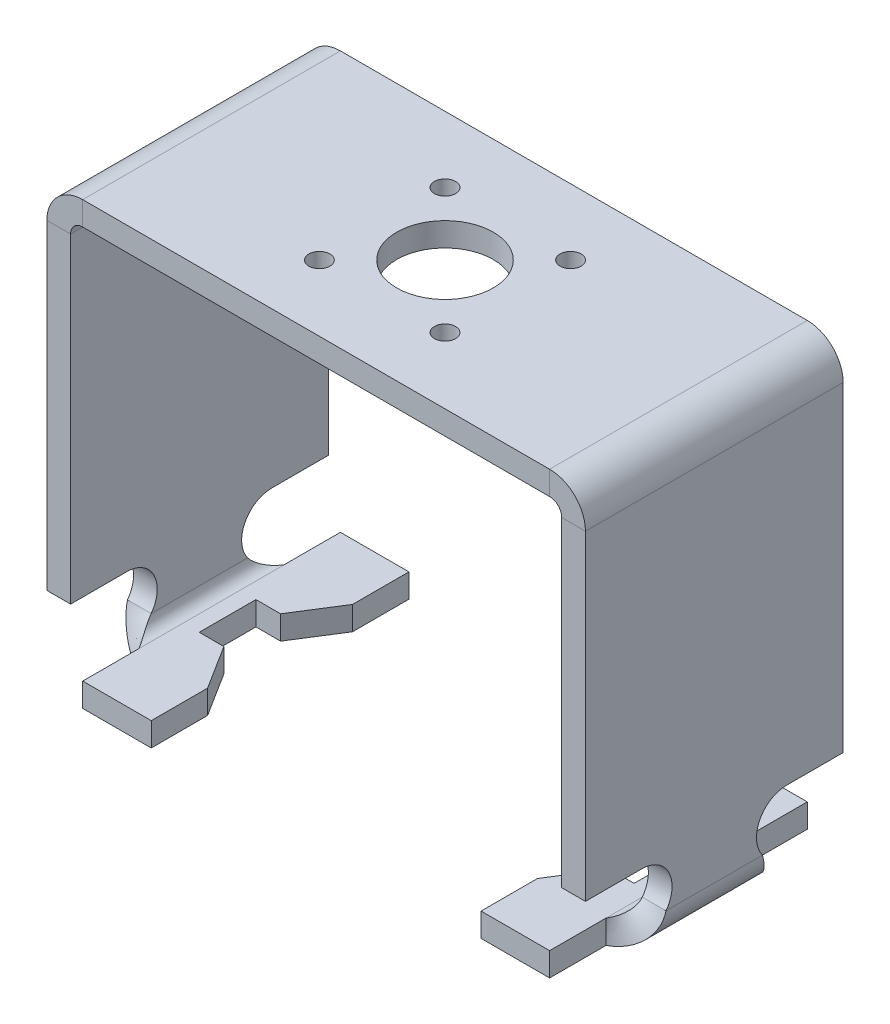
ISO-10303-21;
HEADER;
FILE_DESCRIPTION(('STEP AP214'),'2;1');
FILE_NAME('part.step','',(''),(''),'','','');
FILE_SCHEMA(('AUTOMOTIVE_DESIGN { 1 0 10303 214 1 1 1 1 }'));
ENDSEC;
DATA;
#1=APPLICATION_CONTEXT('core data for automotive mechanical design processes');
#2=APPLICATION_PROTOCOL_DEFINITION('international standard','automotive_design',2000,#1);
#3=PRODUCT_CONTEXT('',#1,'mechanical');
#4=PRODUCT('Part','Part','',(#3));
#5=PRODUCT_RELATED_PRODUCT_CATEGORY('part','',(#4));
#6=PRODUCT_DEFINITION_FORMATION('','',#4);
#7=PRODUCT_DEFINITION_CONTEXT('part definition',#1,'design');
#8=PRODUCT_DEFINITION('design','',#6,#7);
#9=PRODUCT_DEFINITION_SHAPE('','',#8);
#10=(LENGTH_UNIT() NAMED_UNIT(*) SI_UNIT(.MILLI.,.METRE.));
#11=(NAMED_UNIT(*) PLANE_ANGLE_UNIT() SI_UNIT($,.RADIAN.));
#12=(NAMED_UNIT(*) SI_UNIT($,.STERADIAN.) SOLID_ANGLE_UNIT());
#13=UNCERTAINTY_MEASURE_WITH_UNIT(LENGTH_MEASURE(1.E-05),#10,'distance_accuracy_value','');
#14=(GEOMETRIC_REPRESENTATION_CONTEXT(3) GLOBAL_UNCERTAINTY_ASSIGNED_CONTEXT((#13)) GLOBAL_UNIT_ASSIGNED_CONTEXT((#10,
#11,#12)) REPRESENTATION_CONTEXT('',''));
#15=CARTESIAN_POINT('',(0.,0.,0.));
#16=DIRECTION('',(0.,0.,1.));
#17=DIRECTION('',(1.,0.,0.));
#18=AXIS2_PLACEMENT_3D('',#15,#16,#17);
#19=CARTESIAN_POINT('',(-96.8248000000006,-164.3888,-50.8));
#20=DIRECTION('',(0.,1.,0.));
#21=DIRECTION('',(-1.,0.,0.));
#22=AXIS2_PLACEMENT_3D('',#19,#20,#21);
#23=PLANE('',#22);
#24=CARTESIAN_POINT('',(-76.2199999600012,-164.3888,31.57));
#25=DIRECTION('',(0.,-1.,0.));
#26=DIRECTION('',(1.,0.,0.));
#27=AXIS2_PLACEMENT_3D('',#24,#25,#26);
#28=CIRCLE('',#27,7.493);
#29=CARTESIAN_POINT('',(-68.7269999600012,-164.3888,31.57));
#30=VERTEX_POINT('',#29);
#31=EDGE_CURVE('E1487',#30,#30,#28,.T.);
#32=ORIENTED_EDGE('',*,*,#31,.F.);
#33=EDGE_LOOP('',(#32));
#34=FACE_BOUND('',#33,.T.);
#35=CARTESIAN_POINT('',(-76.2199999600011,-164.3888,-31.57));
#36=DIRECTION('',(0.,-1.,0.));
#37=DIRECTION('',(1.,0.,0.));
#38=AXIS2_PLACEMENT_3D('',#35,#36,#37);
#39=CIRCLE('',#38,7.493);
#40=CARTESIAN_POINT('',(-68.7269999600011,-164.3888,-31.57));
#41=VERTEX_POINT('',#40);
#42=EDGE_CURVE('E1481',#41,#41,#39,.T.);
#43=ORIENTED_EDGE('',*,*,#42,.F.);
#44=EDGE_LOOP('',(#43));
#45=FACE_BOUND('',#44,.T.);
#46=DIRECTION('',(0.533876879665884,0.,-0.845562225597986));
#47=VECTOR('',#46,1.);
#48=CARTESIAN_POINT('',(-76.0095000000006,-164.3888,-11.176));
#49=LINE('',#48,#47);
#50=CARTESIAN_POINT('',(-76.0095000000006,-164.3888,-11.176));
#51=VERTEX_POINT('',#50);
#52=CARTESIAN_POINT('',(-65.0240000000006,-164.3888,-28.575));
#53=VERTEX_POINT('',#52);
#54=EDGE_CURVE('E320',#51,#53,#49,.T.);
#55=ORIENTED_EDGE('',*,*,#54,.F.);
#56=DIRECTION('',(1.,0.,0.));
#57=VECTOR('',#56,1.);
#58=CARTESIAN_POINT('',(-85.7250000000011,-164.3888,-11.176));
#59=LINE('',#58,#57);
#60=CARTESIAN_POINT('',(-85.7250000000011,-164.3888,-11.176));
#61=VERTEX_POINT('',#60);
#62=EDGE_CURVE('E1793',#61,#51,#59,.T.);
#63=ORIENTED_EDGE('',*,*,#62,.F.);
#64=DIRECTION('',(0.,0.,-1.));
#65=VECTOR('',#64,1.);
#66=CARTESIAN_POINT('',(-85.7250000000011,-164.3888,11.176));
#67=LINE('',#66,#65);
#68=CARTESIAN_POINT('',(-85.7250000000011,-164.3888,11.176));
#69=VERTEX_POINT('',#68);
#70=EDGE_CURVE('E1797',#69,#61,#67,.T.);
#71=ORIENTED_EDGE('',*,*,#70,.F.);
#72=DIRECTION('',(-1.,0.,0.));
#73=VECTOR('',#72,1.);
#74=CARTESIAN_POINT('',(-85.7250000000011,-164.3888,11.176));
#75=LINE('',#74,#73);
#76=CARTESIAN_POINT('',(-76.0095000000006,-164.3888,11.176));
#77=VERTEX_POINT('',#76);
#78=EDGE_CURVE('E1839',#77,#69,#75,.T.);
#79=ORIENTED_EDGE('',*,*,#78,.F.);
#80=DIRECTION('',(-0.533876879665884,0.,-0.845562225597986));
#81=VECTOR('',#80,1.);
#82=CARTESIAN_POINT('',(-76.0095000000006,-164.3888,11.176));
#83=LINE('',#82,#81);
#84=CARTESIAN_POINT('',(-65.0240000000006,-164.3888,28.575));
#85=VERTEX_POINT('',#84);
#86=EDGE_CURVE('E1836',#85,#77,#83,.T.);
#87=ORIENTED_EDGE('',*,*,#86,.F.);
#88=DIRECTION('',(0.,0.,1.));
#89=VECTOR('',#88,1.);
#90=CARTESIAN_POINT('',(-65.0240000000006,-164.3888,50.8));
#91=LINE('',#90,#89);
#92=CARTESIAN_POINT('',(-65.0240000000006,-164.3888,50.8));
#93=VERTEX_POINT('',#92);
#94=EDGE_CURVE('E512',#85,#93,#91,.T.);
#95=ORIENTED_EDGE('',*,*,#94,.T.);
#96=DIRECTION('',(-1.,0.,0.));
#97=VECTOR('',#96,1.);
#98=CARTESIAN_POINT('',(-96.8248000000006,-164.3888,50.8));
#99=LINE('',#98,#97);
#100=CARTESIAN_POINT('',(-92.0496000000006,-164.3888,50.8));
#101=VERTEX_POINT('',#100);
#102=EDGE_CURVE('E355',#93,#101,#99,.T.);
#103=ORIENTED_EDGE('',*,*,#102,.T.);
#104=DIRECTION('',(0.,0.,-1.));
#105=VECTOR('',#104,1.);
#106=CARTESIAN_POINT('',(-92.0496000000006,-164.3888,-50.8));
#107=LINE('',#106,#105);
#108=CARTESIAN_POINT('',(-92.0496000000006,-164.3888,28.575));
#109=VERTEX_POINT('',#108);
#110=EDGE_CURVE('E519',#101,#109,#107,.T.);
#111=ORIENTED_EDGE('',*,*,#110,.T.);
#112=DIRECTION('',(0.,0.,1.));
#113=VECTOR('',#112,1.);
#114=CARTESIAN_POINT('',(-92.0496000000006,-164.3888,-50.8));
#115=LINE('',#114,#113);
#116=CARTESIAN_POINT('',(-92.0496000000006,-164.3888,-28.575));
#117=VERTEX_POINT('',#116);
#118=EDGE_CURVE('E506',#117,#109,#115,.T.);
#119=ORIENTED_EDGE('',*,*,#118,.F.);
#120=CARTESIAN_POINT('',(-92.0496000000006,-164.3888,-50.8));
#121=VERTEX_POINT('',#120);
#122=EDGE_CURVE('E509',#121,#117,#115,.T.);
#123=ORIENTED_EDGE('',*,*,#122,.F.);
#124=DIRECTION('',(1.,0.,0.));
#125=VECTOR('',#124,1.);
#126=CARTESIAN_POINT('',(-65.0240000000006,-164.3888,-50.8));
#127=LINE('',#126,#125);
#128=CARTESIAN_POINT('',(-65.0240000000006,-164.3888,-50.8));
#129=VERTEX_POINT('',#128);
#130=EDGE_CURVE('E346',#121,#129,#127,.T.);
#131=ORIENTED_EDGE('',*,*,#130,.T.);
#132=EDGE_CURVE('E513',#129,#53,#91,.T.);
#133=ORIENTED_EDGE('',*,*,#132,.T.);
#134=EDGE_LOOP('',(#55,#63,#71,#79,#87,#95,#103,#111,#119,#123,#131,#133));
#135=FACE_BOUND('',#134,.T.);
#136=ADVANCED_FACE('F32',(#34,#45,#135),#23,.F.);
#137=CARTESIAN_POINT('',(-96.8248000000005,-155.0416,-50.8));
#138=DIRECTION('',(0.,1.,0.));
#139=DIRECTION('',(-1.,0.,0.));
#140=AXIS2_PLACEMENT_3D('',#137,#138,#139);
#141=PLANE('',#140);
#142=DIRECTION('',(-1.,0.,0.));
#143=VECTOR('',#142,1.);
#144=CARTESIAN_POINT('',(-96.8248000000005,-155.0416,-11.176));
#145=LINE('',#144,#143);
#146=CARTESIAN_POINT('',(-85.7250000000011,-155.0416,-11.176));
#147=VERTEX_POINT('',#146);
#148=CARTESIAN_POINT('',(-76.0095000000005,-155.0416,-11.176));
#149=VERTEX_POINT('',#148);
#150=EDGE_CURVE('E336',#147,#149,#145,.F.);
#151=ORIENTED_EDGE('',*,*,#150,.T.);
#152=DIRECTION('',(0.533876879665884,0.,-0.845562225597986));
#153=VECTOR('',#152,1.);
#154=CARTESIAN_POINT('',(-76.0095000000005,-155.0416,-11.176));
#155=LINE('',#154,#153);
#156=CARTESIAN_POINT('',(-65.0240000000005,-155.0416,-28.575));
#157=VERTEX_POINT('',#156);
#158=EDGE_CURVE('E317',#149,#157,#155,.T.);
#159=ORIENTED_EDGE('',*,*,#158,.T.);
#160=DIRECTION('',(0.,0.,1.));
#161=VECTOR('',#160,1.);
#162=CARTESIAN_POINT('',(-65.0240000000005,-155.0416,50.8));
#163=LINE('',#162,#161);
#164=CARTESIAN_POINT('',(-65.0240000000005,-155.0416,-50.8));
#165=VERTEX_POINT('',#164);
#166=EDGE_CURVE('E333',#165,#157,#163,.T.);
#167=ORIENTED_EDGE('',*,*,#166,.F.);
#168=DIRECTION('',(1.,0.,0.));
#169=VECTOR('',#168,1.);
#170=CARTESIAN_POINT('',(-65.0240000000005,-155.0416,-50.8));
#171=LINE('',#170,#169);
#172=CARTESIAN_POINT('',(-92.0496000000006,-155.0416,-50.8));
#173=VERTEX_POINT('',#172);
#174=EDGE_CURVE('E348',#173,#165,#171,.T.);
#175=ORIENTED_EDGE('',*,*,#174,.F.);
#176=DIRECTION('',(0.,0.,-1.));
#177=VECTOR('',#176,1.);
#178=CARTESIAN_POINT('',(-92.0496000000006,-155.0416,-50.8));
#179=LINE('',#178,#177);
#180=CARTESIAN_POINT('',(-92.0496000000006,-155.0416,-28.575));
#181=VERTEX_POINT('',#180);
#182=EDGE_CURVE('E535',#173,#181,#179,.F.);
#183=ORIENTED_EDGE('',*,*,#182,.T.);
#184=DIRECTION('',(0.,0.,-1.));
#185=VECTOR('',#184,1.);
#186=CARTESIAN_POINT('',(-92.0496000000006,-155.0416,50.8));
#187=LINE('',#186,#185);
#188=CARTESIAN_POINT('',(-92.0496000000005,-155.0416,28.575));
#189=VERTEX_POINT('',#188);
#190=EDGE_CURVE('E504',#189,#181,#187,.T.);
#191=ORIENTED_EDGE('',*,*,#190,.F.);
#192=CARTESIAN_POINT('',(-92.0496000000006,-155.0416,50.8));
#193=VERTEX_POINT('',#192);
#194=EDGE_CURVE('E501',#193,#189,#187,.T.);
#195=ORIENTED_EDGE('',*,*,#194,.F.);
#196=DIRECTION('',(-1.,0.,0.));
#197=VECTOR('',#196,1.);
#198=CARTESIAN_POINT('',(-96.8248000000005,-155.0416,50.8));
#199=LINE('',#198,#197);
#200=CARTESIAN_POINT('',(-65.0240000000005,-155.0416,50.8));
#201=VERTEX_POINT('',#200);
#202=EDGE_CURVE('E342',#201,#193,#199,.T.);
#203=ORIENTED_EDGE('',*,*,#202,.F.);
#204=CARTESIAN_POINT('',(-65.0240000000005,-155.0416,28.575));
#205=VERTEX_POINT('',#204);
#206=EDGE_CURVE('E343',#205,#201,#163,.T.);
#207=ORIENTED_EDGE('',*,*,#206,.F.);
#208=DIRECTION('',(-0.533876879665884,0.,-0.845562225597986));
#209=VECTOR('',#208,1.);
#210=CARTESIAN_POINT('',(-76.0095000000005,-155.0416,11.176));
#211=LINE('',#210,#209);
#212=CARTESIAN_POINT('',(-76.0095000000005,-155.0416,11.176));
#213=VERTEX_POINT('',#212);
#214=EDGE_CURVE('E47',#205,#213,#211,.T.);
#215=ORIENTED_EDGE('',*,*,#214,.T.);
#216=DIRECTION('',(-1.,0.,0.));
#217=VECTOR('',#216,1.);
#218=CARTESIAN_POINT('',(-96.8248000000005,-155.0416,11.176));
#219=LINE('',#218,#217);
#220=CARTESIAN_POINT('',(-85.7250000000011,-155.0416,11.176));
#221=VERTEX_POINT('',#220);
#222=EDGE_CURVE('E1795',#213,#221,#219,.T.);
#223=ORIENTED_EDGE('',*,*,#222,.T.);
#224=DIRECTION('',(0.,0.,1.));
#225=VECTOR('',#224,1.);
#226=CARTESIAN_POINT('',(-85.7250000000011,-155.0416,-50.8));
#227=LINE('',#226,#225);
#228=EDGE_CURVE('E1846',#221,#147,#227,.F.);
#229=ORIENTED_EDGE('',*,*,#228,.T.);
#230=EDGE_LOOP('',(#151,#159,#167,#175,#183,#191,#195,#203,#207,#215,#223,#229));
#231=FACE_BOUND('',#230,.T.);
#232=ADVANCED_FACE('F331',(#231),#141,.T.);
#233=CARTESIAN_POINT('',(-65.0240000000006,-164.3888,50.8));
#234=DIRECTION('',(-1.,0.,0.));
#235=DIRECTION('',(0.,-1.,0.));
#236=AXIS2_PLACEMENT_3D('',#233,#234,#235);
#237=PLANE('',#236);
#238=DIRECTION('',(0.,-1.,0.));
#239=VECTOR('',#238,1.);
#240=CARTESIAN_POINT('',(-65.0240000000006,-164.3888,-28.575));
#241=LINE('',#240,#239);
#242=EDGE_CURVE('E313',#53,#157,#241,.F.);
#243=ORIENTED_EDGE('',*,*,#242,.F.);
#244=ORIENTED_EDGE('',*,*,#132,.F.);
#245=DIRECTION('',(0.,1.,0.));
#246=VECTOR('',#245,1.);
#247=CARTESIAN_POINT('',(-65.0240000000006,-164.3888,-50.8));
#248=LINE('',#247,#246);
#249=EDGE_CURVE('E341',#129,#165,#248,.T.);
#250=ORIENTED_EDGE('',*,*,#249,.T.);
#251=ORIENTED_EDGE('',*,*,#166,.T.);
#252=EDGE_LOOP('',(#243,#244,#250,#251));
#253=FACE_BOUND('',#252,.T.);
#254=ADVANCED_FACE('F339',(#253),#237,.F.);
#255=DIRECTION('',(0.,-1.,0.));
#256=VECTOR('',#255,1.);
#257=CARTESIAN_POINT('',(-65.0240000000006,-164.3888,28.575));
#258=LINE('',#257,#256);
#259=EDGE_CURVE('E326',#85,#205,#258,.F.);
#260=ORIENTED_EDGE('',*,*,#259,.T.);
#261=ORIENTED_EDGE('',*,*,#206,.T.);
#262=DIRECTION('',(0.,1.,0.));
#263=VECTOR('',#262,1.);
#264=CARTESIAN_POINT('',(-65.0240000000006,-164.3888,50.8));
#265=LINE('',#264,#263);
#266=EDGE_CURVE('E352',#93,#201,#265,.T.);
#267=ORIENTED_EDGE('',*,*,#266,.F.);
#268=ORIENTED_EDGE('',*,*,#94,.F.);
#269=EDGE_LOOP('',(#260,#261,#267,#268));
#270=FACE_BOUND('',#269,.T.);
#271=ADVANCED_FACE('F643',(#270),#237,.F.);
#272=CARTESIAN_POINT('',(96.8248000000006,-164.3888,-50.8));
#273=DIRECTION('',(0.,1.,0.));
#274=DIRECTION('',(1.,0.,0.));
#275=AXIS2_PLACEMENT_3D('',#272,#273,#274);
#276=PLANE('',#275);
#277=CARTESIAN_POINT('',(76.2199999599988,-164.388800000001,31.57));
#278=DIRECTION('',(0.,-1.,0.));
#279=DIRECTION('',(1.,0.,0.));
#280=AXIS2_PLACEMENT_3D('',#277,#278,#279);
#281=CIRCLE('',#280,7.493);
#282=CARTESIAN_POINT('',(83.7129999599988,-164.388800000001,31.57));
#283=VERTEX_POINT('',#282);
#284=EDGE_CURVE('E1476',#283,#283,#281,.T.);
#285=ORIENTED_EDGE('',*,*,#284,.F.);
#286=EDGE_LOOP('',(#285));
#287=FACE_BOUND('',#286,.T.);
#288=CARTESIAN_POINT('',(76.2199999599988,-164.388800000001,-31.57));
#289=DIRECTION('',(0.,-1.,0.));
#290=DIRECTION('',(1.,0.,0.));
#291=AXIS2_PLACEMENT_3D('',#288,#289,#290);
#292=CIRCLE('',#291,7.493);
#293=CARTESIAN_POINT('',(83.7129999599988,-164.388800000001,-31.57));
#294=VERTEX_POINT('',#293);
#295=EDGE_CURVE('E1463',#294,#294,#292,.T.);
#296=ORIENTED_EDGE('',*,*,#295,.F.);
#297=EDGE_LOOP('',(#296));
#298=FACE_BOUND('',#297,.T.);
#299=DIRECTION('',(-0.533876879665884,0.,0.845562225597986));
#300=VECTOR('',#299,1.);
#301=CARTESIAN_POINT('',(76.0094999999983,-164.388800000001,11.176));
#302=LINE('',#301,#300);
#303=CARTESIAN_POINT('',(76.0094999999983,-164.388800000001,11.176));
#304=VERTEX_POINT('',#303);
#305=CARTESIAN_POINT('',(65.0239999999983,-164.388800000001,28.575));
#306=VERTEX_POINT('',#305);
#307=EDGE_CURVE('E1735',#304,#306,#302,.T.);
#308=ORIENTED_EDGE('',*,*,#307,.F.);
#309=DIRECTION('',(-1.,0.,0.));
#310=VECTOR('',#309,1.);
#311=CARTESIAN_POINT('',(76.0094999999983,-164.388800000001,11.176));
#312=LINE('',#311,#310);
#313=CARTESIAN_POINT('',(85.7249999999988,-164.388800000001,11.176));
#314=VERTEX_POINT('',#313);
#315=EDGE_CURVE('E1737',#314,#304,#312,.T.);
#316=ORIENTED_EDGE('',*,*,#315,.F.);
#317=DIRECTION('',(0.,0.,1.));
#318=VECTOR('',#317,1.);
#319=CARTESIAN_POINT('',(85.7249999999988,-164.388800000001,11.176));
#320=LINE('',#319,#318);
#321=CARTESIAN_POINT('',(85.7249999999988,-164.388800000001,-11.176));
#322=VERTEX_POINT('',#321);
#323=EDGE_CURVE('E1742',#322,#314,#320,.T.);
#324=ORIENTED_EDGE('',*,*,#323,.F.);
#325=DIRECTION('',(1.,0.,0.));
#326=VECTOR('',#325,1.);
#327=CARTESIAN_POINT('',(76.0094999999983,-164.388800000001,-11.176));
#328=LINE('',#327,#326);
#329=CARTESIAN_POINT('',(76.0094999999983,-164.388800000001,-11.176));
#330=VERTEX_POINT('',#329);
#331=EDGE_CURVE('E1822',#330,#322,#328,.T.);
#332=ORIENTED_EDGE('',*,*,#331,.F.);
#333=DIRECTION('',(0.533876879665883,0.,0.845562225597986));
#334=VECTOR('',#333,1.);
#335=CARTESIAN_POINT('',(76.0094999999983,-164.388800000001,-11.176));
#336=LINE('',#335,#334);
#337=CARTESIAN_POINT('',(65.0239999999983,-164.388800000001,-28.5749999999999));
#338=VERTEX_POINT('',#337);
#339=EDGE_CURVE('E1809',#338,#330,#336,.T.);
#340=ORIENTED_EDGE('',*,*,#339,.F.);
#341=DIRECTION('',(0.,0.,1.));
#342=VECTOR('',#341,1.);
#343=CARTESIAN_POINT('',(65.0240000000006,-164.3888,50.8));
#344=LINE('',#343,#342);
#345=CARTESIAN_POINT('',(65.0240000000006,-164.3888,-50.8));
#346=VERTEX_POINT('',#345);
#347=EDGE_CURVE('E1514',#346,#338,#344,.T.);
#348=ORIENTED_EDGE('',*,*,#347,.F.);
#349=DIRECTION('',(-1.,0.,0.));
#350=VECTOR('',#349,1.);
#351=CARTESIAN_POINT('',(65.0240000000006,-164.3888,-50.8));
#352=LINE('',#351,#350);
#353=CARTESIAN_POINT('',(92.0496000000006,-164.3888,-50.8));
#354=VERTEX_POINT('',#353);
#355=EDGE_CURVE('E1507',#354,#346,#352,.T.);
#356=ORIENTED_EDGE('',*,*,#355,.F.);
#357=DIRECTION('',(0.,0.,1.));
#358=VECTOR('',#357,1.);
#359=CARTESIAN_POINT('',(92.0496000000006,-164.3888,50.8));
#360=LINE('',#359,#358);
#361=CARTESIAN_POINT('',(92.0496000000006,-164.3888,-28.575));
#362=VERTEX_POINT('',#361);
#363=EDGE_CURVE('E1696',#354,#362,#360,.T.);
#364=ORIENTED_EDGE('',*,*,#363,.T.);
#365=DIRECTION('',(0.,0.,-1.));
#366=VECTOR('',#365,1.);
#367=CARTESIAN_POINT('',(92.0496000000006,-164.3888,-50.8));
#368=LINE('',#367,#366);
#369=CARTESIAN_POINT('',(92.0496000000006,-164.3888,28.575));
#370=VERTEX_POINT('',#369);
#371=EDGE_CURVE('E1501',#370,#362,#368,.T.);
#372=ORIENTED_EDGE('',*,*,#371,.F.);
#373=CARTESIAN_POINT('',(92.0496000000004,-164.3888,50.8));
#374=VERTEX_POINT('',#373);
#375=EDGE_CURVE('E1504',#374,#370,#368,.T.);
#376=ORIENTED_EDGE('',*,*,#375,.F.);
#377=DIRECTION('',(1.,0.,0.));
#378=VECTOR('',#377,1.);
#379=CARTESIAN_POINT('',(96.8248000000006,-164.3888,50.8));
#380=LINE('',#379,#378);
#381=CARTESIAN_POINT('',(65.0240000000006,-164.3888,50.8));
#382=VERTEX_POINT('',#381);
#383=EDGE_CURVE('E1509',#382,#374,#380,.T.);
#384=ORIENTED_EDGE('',*,*,#383,.F.);
#385=EDGE_CURVE('E1513',#306,#382,#344,.T.);
#386=ORIENTED_EDGE('',*,*,#385,.F.);
#387=EDGE_LOOP('',(#308,#316,#324,#332,#340,#348,#356,#364,#372,#376,#384,#386));
#388=FACE_BOUND('',#387,.T.);
#389=ADVANCED_FACE('F639',(#287,#298,#388),#276,.F.);
#390=CARTESIAN_POINT('',(96.8248000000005,-155.0416,-50.8));
#391=DIRECTION('',(0.,1.,0.));
#392=DIRECTION('',(1.,0.,0.));
#393=AXIS2_PLACEMENT_3D('',#390,#391,#392);
#394=PLANE('',#393);
#395=DIRECTION('',(1.,0.,0.));
#396=VECTOR('',#395,1.);
#397=CARTESIAN_POINT('',(96.8248000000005,-155.0416,11.176));
#398=LINE('',#397,#396);
#399=CARTESIAN_POINT('',(85.7249999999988,-155.0416,11.176));
#400=VERTEX_POINT('',#399);
#401=CARTESIAN_POINT('',(76.0094999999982,-155.0416,11.176));
#402=VERTEX_POINT('',#401);
#403=EDGE_CURVE('E1813',#400,#402,#398,.F.);
#404=ORIENTED_EDGE('',*,*,#403,.T.);
#405=DIRECTION('',(-0.533876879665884,0.,0.845562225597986));
#406=VECTOR('',#405,1.);
#407=CARTESIAN_POINT('',(76.0094999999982,-155.041600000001,11.176));
#408=LINE('',#407,#406);
#409=CARTESIAN_POINT('',(65.0239999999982,-155.0416,28.575));
#410=VERTEX_POINT('',#409);
#411=EDGE_CURVE('E1760',#402,#410,#408,.T.);
#412=ORIENTED_EDGE('',*,*,#411,.T.);
#413=DIRECTION('',(0.,0.,1.));
#414=VECTOR('',#413,1.);
#415=CARTESIAN_POINT('',(65.0240000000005,-155.0416,50.8));
#416=LINE('',#415,#414);
#417=CARTESIAN_POINT('',(65.0240000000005,-155.0416,50.8));
#418=VERTEX_POINT('',#417);
#419=EDGE_CURVE('E1522',#410,#418,#416,.T.);
#420=ORIENTED_EDGE('',*,*,#419,.T.);
#421=DIRECTION('',(1.,0.,0.));
#422=VECTOR('',#421,1.);
#423=CARTESIAN_POINT('',(96.8248000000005,-155.0416,50.8));
#424=LINE('',#423,#422);
#425=CARTESIAN_POINT('',(92.0496000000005,-155.0416,50.8));
#426=VERTEX_POINT('',#425);
#427=EDGE_CURVE('E1519',#418,#426,#424,.T.);
#428=ORIENTED_EDGE('',*,*,#427,.T.);
#429=DIRECTION('',(0.,0.,1.));
#430=VECTOR('',#429,1.);
#431=CARTESIAN_POINT('',(92.0496000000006,-155.0416,50.8));
#432=LINE('',#431,#430);
#433=CARTESIAN_POINT('',(92.0496000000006,-155.0416,28.575));
#434=VERTEX_POINT('',#433);
#435=EDGE_CURVE('E1635',#426,#434,#432,.F.);
#436=ORIENTED_EDGE('',*,*,#435,.T.);
#437=DIRECTION('',(0.,0.,1.));
#438=VECTOR('',#437,1.);
#439=CARTESIAN_POINT('',(92.0496000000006,-155.0416,-50.8));
#440=LINE('',#439,#438);
#441=CARTESIAN_POINT('',(92.0496000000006,-155.0416,-28.575));
#442=VERTEX_POINT('',#441);
#443=EDGE_CURVE('E1499',#442,#434,#440,.T.);
#444=ORIENTED_EDGE('',*,*,#443,.F.);
#445=CARTESIAN_POINT('',(92.0496000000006,-155.0416,-50.8));
#446=VERTEX_POINT('',#445);
#447=EDGE_CURVE('E1496',#446,#442,#440,.T.);
#448=ORIENTED_EDGE('',*,*,#447,.F.);
#449=DIRECTION('',(-1.,0.,0.));
#450=VECTOR('',#449,1.);
#451=CARTESIAN_POINT('',(65.0240000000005,-155.0416,-50.8));
#452=LINE('',#451,#450);
#453=CARTESIAN_POINT('',(65.0240000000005,-155.0416,-50.8));
#454=VERTEX_POINT('',#453);
#455=EDGE_CURVE('E1506',#446,#454,#452,.T.);
#456=ORIENTED_EDGE('',*,*,#455,.T.);
#457=CARTESIAN_POINT('',(65.0240000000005,-155.0416,-28.5749999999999));
#458=VERTEX_POINT('',#457);
#459=EDGE_CURVE('E1510',#454,#458,#416,.T.);
#460=ORIENTED_EDGE('',*,*,#459,.T.);
#461=DIRECTION('',(0.533876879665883,0.,0.845562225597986));
#462=VECTOR('',#461,1.);
#463=CARTESIAN_POINT('',(76.0094999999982,-155.041600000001,-11.176));
#464=LINE('',#463,#462);
#465=CARTESIAN_POINT('',(76.0094999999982,-155.0416,-11.176));
#466=VERTEX_POINT('',#465);
#467=EDGE_CURVE('E55',#458,#466,#464,.T.);
#468=ORIENTED_EDGE('',*,*,#467,.T.);
#469=DIRECTION('',(1.,0.,0.));
#470=VECTOR('',#469,1.);
#471=CARTESIAN_POINT('',(96.8248000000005,-155.0416,-11.176));
#472=LINE('',#471,#470);
#473=CARTESIAN_POINT('',(85.7249999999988,-155.0416,-11.176));
#474=VERTEX_POINT('',#473);
#475=EDGE_CURVE('E1740',#466,#474,#472,.T.);
#476=ORIENTED_EDGE('',*,*,#475,.T.);
#477=DIRECTION('',(0.,0.,-1.));
#478=VECTOR('',#477,1.);
#479=CARTESIAN_POINT('',(85.7249999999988,-155.0416,-50.8));
#480=LINE('',#479,#478);
#481=EDGE_CURVE('E1816',#474,#400,#480,.F.);
#482=ORIENTED_EDGE('',*,*,#481,.T.);
#483=EDGE_LOOP('',(#404,#412,#420,#428,#436,#444,#448,#456,#460,#468,#476,#482));
#484=FACE_BOUND('',#483,.T.);
#485=ADVANCED_FACE('F642',(#484),#394,.T.);
#486=CARTESIAN_POINT('',(65.0240000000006,-164.3888,50.8));
#487=DIRECTION('',(-1.,0.,0.));
#488=DIRECTION('',(0.,-1.,0.));
#489=AXIS2_PLACEMENT_3D('',#486,#487,#488);
#490=PLANE('',#489);
#491=ORIENTED_EDGE('',*,*,#419,.F.);
#492=DIRECTION('',(0.,-1.,0.));
#493=VECTOR('',#492,1.);
#494=CARTESIAN_POINT('',(65.0239999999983,-164.388800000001,28.575));
#495=LINE('',#494,#493);
#496=EDGE_CURVE('E1733',#306,#410,#495,.F.);
#497=ORIENTED_EDGE('',*,*,#496,.F.);
#498=ORIENTED_EDGE('',*,*,#385,.T.);
#499=DIRECTION('',(0.,1.,0.));
#500=VECTOR('',#499,1.);
#501=CARTESIAN_POINT('',(65.0240000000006,-164.3888,50.8));
#502=LINE('',#501,#500);
#503=EDGE_CURVE('E1527',#382,#418,#502,.T.);
#504=ORIENTED_EDGE('',*,*,#503,.T.);
#505=EDGE_LOOP('',(#491,#497,#498,#504));
#506=FACE_BOUND('',#505,.T.);
#507=ADVANCED_FACE('F647',(#506),#490,.T.);
#508=ORIENTED_EDGE('',*,*,#347,.T.);
#509=DIRECTION('',(0.,-1.,0.));
#510=VECTOR('',#509,1.);
#511=CARTESIAN_POINT('',(65.0239999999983,-164.388800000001,-28.5749999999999));
#512=LINE('',#511,#510);
#513=EDGE_CURVE('E1746',#338,#458,#512,.F.);
#514=ORIENTED_EDGE('',*,*,#513,.T.);
#515=ORIENTED_EDGE('',*,*,#459,.F.);
#516=DIRECTION('',(0.,1.,0.));
#517=VECTOR('',#516,1.);
#518=CARTESIAN_POINT('',(65.0240000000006,-164.3888,-50.8));
#519=LINE('',#518,#517);
#520=EDGE_CURVE('E1517',#346,#454,#519,.T.);
#521=ORIENTED_EDGE('',*,*,#520,.F.);
#522=EDGE_LOOP('',(#508,#514,#515,#521));
#523=FACE_BOUND('',#522,.T.);
#524=ADVANCED_FACE('F651',(#523),#490,.T.);
#525=CARTESIAN_POINT('',(-106.172,0.,-50.8));
#526=DIRECTION('',(1.,0.,0.));
#527=DIRECTION('',(0.,1.,0.));
#528=AXIS2_PLACEMENT_3D('',#525,#526,#527);
#529=PLANE('',#528);
#530=DIRECTION('',(0.,0.,1.));
#531=VECTOR('',#530,1.);
#532=CARTESIAN_POINT('',(-106.172,-131.1656,-50.8));
#533=LINE('',#532,#531);
#534=CARTESIAN_POINT('',(-106.172,-131.1656,-50.8));
#535=VERTEX_POINT('',#534);
#536=CARTESIAN_POINT('',(-106.172,-131.1656,-28.575));
#537=VERTEX_POINT('',#536);
#538=EDGE_CURVE('E458',#535,#537,#533,.T.);
#539=ORIENTED_EDGE('',*,*,#538,.T.);
#540=CARTESIAN_POINT('',(-106.172,-143.1036,-28.575));
#541=DIRECTION('',(1.,0.,0.));
#542=DIRECTION('',(0.,1.,0.));
#543=AXIS2_PLACEMENT_3D('',#540,#541,#542);
#544=CIRCLE('',#543,11.938);
#545=CARTESIAN_POINT('',(-106.172000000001,-150.2664,-19.0246));
#546=VERTEX_POINT('',#545);
#547=EDGE_CURVE('E1622',#537,#546,#544,.T.);
#548=ORIENTED_EDGE('',*,*,#547,.T.);
#549=DIRECTION('',(0.,0.,-1.));
#550=VECTOR('',#549,1.);
#551=CARTESIAN_POINT('',(-106.172000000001,-150.2664,-50.8));
#552=LINE('',#551,#550);
#553=CARTESIAN_POINT('',(-106.172000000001,-150.2664,19.0246));
#554=VERTEX_POINT('',#553);
#555=EDGE_CURVE('E358',#546,#554,#552,.F.);
#556=ORIENTED_EDGE('',*,*,#555,.T.);
#557=CARTESIAN_POINT('',(-106.172000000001,-143.1036,28.575));
#558=DIRECTION('',(1.,0.,0.));
#559=DIRECTION('',(0.,0.,1.));
#560=AXIS2_PLACEMENT_3D('',#557,#558,#559);
#561=CIRCLE('',#560,11.938);
#562=CARTESIAN_POINT('',(-106.172000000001,-131.1656,28.575));
#563=VERTEX_POINT('',#562);
#564=EDGE_CURVE('E1577',#554,#563,#561,.T.);
#565=ORIENTED_EDGE('',*,*,#564,.T.);
#566=DIRECTION('',(0.,0.,1.));
#567=VECTOR('',#566,1.);
#568=CARTESIAN_POINT('',(-106.172000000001,-131.1656,28.575));
#569=LINE('',#568,#567);
#570=CARTESIAN_POINT('',(-106.172000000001,-131.1656,50.8));
#571=VERTEX_POINT('',#570);
#572=EDGE_CURVE('E1579',#563,#571,#569,.T.);
#573=ORIENTED_EDGE('',*,*,#572,.T.);
#574=DIRECTION('',(0.,1.,0.));
#575=VECTOR('',#574,1.);
#576=CARTESIAN_POINT('',(-106.172,0.,50.8));
#577=LINE('',#576,#575);
#578=CARTESIAN_POINT('',(-106.172,-4.77519999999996,50.8));
#579=VERTEX_POINT('',#578);
#580=EDGE_CURVE('E376',#571,#579,#577,.T.);
#581=ORIENTED_EDGE('',*,*,#580,.T.);
#582=DIRECTION('',(0.,0.,1.));
#583=VECTOR('',#582,1.);
#584=CARTESIAN_POINT('',(-106.172,-4.77519999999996,-50.8));
#585=LINE('',#584,#583);
#586=CARTESIAN_POINT('',(-106.172,-4.77519999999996,-50.8));
#587=VERTEX_POINT('',#586);
#588=EDGE_CURVE('E367',#587,#579,#585,.T.);
#589=ORIENTED_EDGE('',*,*,#588,.F.);
#590=DIRECTION('',(0.,-1.,0.));
#591=VECTOR('',#590,1.);
#592=CARTESIAN_POINT('',(-106.172000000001,-155.0416,-50.8));
#593=LINE('',#592,#591);
#594=EDGE_CURVE('E373',#587,#535,#593,.T.);
#595=ORIENTED_EDGE('',*,*,#594,.T.);
#596=EDGE_LOOP('',(#539,#548,#556,#565,#573,#581,#589,#595));
#597=FACE_BOUND('',#596,.T.);
#598=ADVANCED_FACE('F456',(#597),#529,.F.);
#599=CARTESIAN_POINT('',(-96.8248,0.,-50.8));
#600=DIRECTION('',(1.,0.,0.));
#601=DIRECTION('',(0.,1.,0.));
#602=AXIS2_PLACEMENT_3D('',#599,#600,#601);
#603=PLANE('',#602);
#604=CARTESIAN_POINT('',(-96.8248000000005,-143.1036,-28.575));
#605=DIRECTION('',(1.,0.,0.));
#606=DIRECTION('',(0.,1.,0.));
#607=AXIS2_PLACEMENT_3D('',#604,#605,#606);
#608=CIRCLE('',#607,11.938);
#609=CARTESIAN_POINT('',(-96.8248000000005,-131.1656,-28.575));
#610=VERTEX_POINT('',#609);
#611=CARTESIAN_POINT('',(-96.8248000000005,-150.2664,-19.0246));
#612=VERTEX_POINT('',#611);
#613=EDGE_CURVE('E1617',#610,#612,#608,.T.);
#614=ORIENTED_EDGE('',*,*,#613,.F.);
#615=DIRECTION('',(0.,0.,1.));
#616=VECTOR('',#615,1.);
#617=CARTESIAN_POINT('',(-96.8248000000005,-131.1656,-50.7999999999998));
#618=LINE('',#617,#616);
#619=CARTESIAN_POINT('',(-96.8248000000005,-131.1656,-50.8));
#620=VERTEX_POINT('',#619);
#621=EDGE_CURVE('E1618',#620,#610,#618,.T.);
#622=ORIENTED_EDGE('',*,*,#621,.F.);
#623=DIRECTION('',(0.,-1.,0.));
#624=VECTOR('',#623,1.);
#625=CARTESIAN_POINT('',(-96.8248000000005,-155.0416,-50.8));
#626=LINE('',#625,#624);
#627=CARTESIAN_POINT('',(-96.8248,-4.77519999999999,-50.8));
#628=VERTEX_POINT('',#627);
#629=EDGE_CURVE('E372',#628,#620,#626,.T.);
#630=ORIENTED_EDGE('',*,*,#629,.F.);
#631=DIRECTION('',(0.,0.,-1.));
#632=VECTOR('',#631,1.);
#633=CARTESIAN_POINT('',(-96.8248,-4.77519999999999,50.8));
#634=LINE('',#633,#632);
#635=CARTESIAN_POINT('',(-96.8248,-4.77519999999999,50.8));
#636=VERTEX_POINT('',#635);
#637=EDGE_CURVE('E362',#636,#628,#634,.T.);
#638=ORIENTED_EDGE('',*,*,#637,.F.);
#639=DIRECTION('',(0.,1.,0.));
#640=VECTOR('',#639,1.);
#641=CARTESIAN_POINT('',(-96.8248,0.,50.8));
#642=LINE('',#641,#640);
#643=CARTESIAN_POINT('',(-96.8248000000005,-131.1656,50.8));
#644=VERTEX_POINT('',#643);
#645=EDGE_CURVE('E377',#644,#636,#642,.T.);
#646=ORIENTED_EDGE('',*,*,#645,.F.);
#647=DIRECTION('',(0.,0.,1.));
#648=VECTOR('',#647,1.);
#649=CARTESIAN_POINT('',(-96.8248000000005,-131.1656,-50.8));
#650=LINE('',#649,#648);
#651=CARTESIAN_POINT('',(-96.8248000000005,-131.1656,28.575));
#652=VERTEX_POINT('',#651);
#653=EDGE_CURVE('E442',#652,#644,#650,.T.);
#654=ORIENTED_EDGE('',*,*,#653,.F.);
#655=CARTESIAN_POINT('',(-96.8248000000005,-143.1036,28.575));
#656=DIRECTION('',(1.,0.,0.));
#657=DIRECTION('',(0.,0.,-1.));
#658=AXIS2_PLACEMENT_3D('',#655,#656,#657);
#659=CIRCLE('',#658,11.938);
#660=CARTESIAN_POINT('',(-96.8248000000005,-150.2664,19.0246));
#661=VERTEX_POINT('',#660);
#662=EDGE_CURVE('E567',#661,#652,#659,.T.);
#663=ORIENTED_EDGE('',*,*,#662,.F.);
#664=DIRECTION('',(0.,0.,-1.));
#665=VECTOR('',#664,1.);
#666=CARTESIAN_POINT('',(-96.8248000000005,-150.2664,-50.8));
#667=LINE('',#666,#665);
#668=EDGE_CURVE('E357',#612,#661,#667,.F.);
#669=ORIENTED_EDGE('',*,*,#668,.F.);
#670=EDGE_LOOP('',(#614,#622,#630,#638,#646,#654,#663,#669));
#671=FACE_BOUND('',#670,.T.);
#672=ADVANCED_FACE('F440',(#671),#603,.T.);
#673=CARTESIAN_POINT('',(-92.0496000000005,-150.2664,-50.8));
#674=DIRECTION('',(0.,0.,-1.));
#675=DIRECTION('',(0.,-1.,0.));
#676=AXIS2_PLACEMENT_3D('',#673,#674,#675);
#677=CYLINDRICAL_SURFACE('',#676,14.1224);
#678=ORIENTED_EDGE('',*,*,#555,.F.);
#679=CARTESIAN_POINT('',(-92.0496000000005,-164.3888,-28.575));
#680=CARTESIAN_POINT('',(-92.3488898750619,-164.388807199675,-28.414990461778));
#681=CARTESIAN_POINT('',(-92.6481821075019,-164.379286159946,-28.2549844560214));
#682=CARTESIAN_POINT('',(-93.2457316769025,-164.341236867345,-27.9352370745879));
#683=CARTESIAN_POINT('',(-93.5439889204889,-164.312706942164,-27.7754957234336));
#684=CARTESIAN_POINT('',(-94.1383847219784,-164.236688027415,-27.45655871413));
#685=CARTESIAN_POINT('',(-94.434523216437,-164.189198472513,-27.2973630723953));
#686=CARTESIAN_POINT('',(-95.0239947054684,-164.075288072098,-26.9795875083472));
#687=CARTESIAN_POINT('',(-95.3173234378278,-164.008842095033,-26.8210086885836));
#688=CARTESIAN_POINT('',(-95.8996912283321,-163.85718752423,-26.5049642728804));
#689=CARTESIAN_POINT('',(-96.1887304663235,-163.771979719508,-26.3474986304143));
#690=CARTESIAN_POINT('',(-96.7614319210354,-163.582997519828,-26.033987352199));
#691=CARTESIAN_POINT('',(-97.0450941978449,-163.47922333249,-25.8779417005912));
#692=CARTESIAN_POINT('',(-97.7445555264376,-163.197510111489,-25.490832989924));
#693=CARTESIAN_POINT('',(-98.1564214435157,-163.008255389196,-25.260784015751));
#694=CARTESIAN_POINT('',(-98.9620324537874,-162.589814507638,-24.8053637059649));
#695=CARTESIAN_POINT('',(-99.3557771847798,-162.360627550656,-24.5799924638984));
#696=CARTESIAN_POINT('',(-100.121181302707,-161.863801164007,-24.1351201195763));
#697=CARTESIAN_POINT('',(-100.492859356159,-161.596194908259,-23.9156141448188));
#698=CARTESIAN_POINT('',(-101.21074438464,-161.02401544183,-23.4832321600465));
#699=CARTESIAN_POINT('',(-101.556952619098,-160.719444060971,-23.2703558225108));
#700=CARTESIAN_POINT('',(-102.206994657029,-160.088137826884,-22.860477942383));
#701=CARTESIAN_POINT('',(-102.511966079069,-159.762766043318,-22.6631817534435));
#702=CARTESIAN_POINT('',(-103.091735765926,-159.081918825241,-22.2763324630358));
#703=CARTESIAN_POINT('',(-103.366534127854,-158.726443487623,-22.0867793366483));
#704=CARTESIAN_POINT('',(-103.882975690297,-157.987576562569,-21.7161756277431));
#705=CARTESIAN_POINT('',(-104.124601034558,-157.604170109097,-21.5351296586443));
#706=CARTESIAN_POINT('',(-104.459642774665,-157.010634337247,-21.2706328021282));
#707=CARTESIAN_POINT('',(-104.566765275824,-156.8097001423,-21.1836387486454));
#708=CARTESIAN_POINT('',(-104.771547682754,-156.402055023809,-21.0121080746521));
#709=CARTESIAN_POINT('',(-104.869207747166,-156.195344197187,-20.9275714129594));
#710=CARTESIAN_POINT('',(-105.135370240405,-155.594437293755,-20.6885648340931));
#711=CARTESIAN_POINT('',(-105.291658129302,-155.193464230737,-20.5371831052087));
#712=CARTESIAN_POINT('',(-105.498686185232,-154.58043255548,-20.3170262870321));
#713=CARTESIAN_POINT('',(-105.563138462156,-154.374117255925,-20.2447794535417));
#714=CARTESIAN_POINT('',(-105.682695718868,-153.957976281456,-20.1026839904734));
#715=CARTESIAN_POINT('',(-105.737800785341,-153.748150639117,-20.0328353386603));
#716=CARTESIAN_POINT('',(-105.888460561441,-153.115227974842,-19.8273096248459));
#717=CARTESIAN_POINT('',(-105.969767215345,-152.687481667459,-19.6952218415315));
#718=CARTESIAN_POINT('',(-106.092647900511,-151.8236757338,-19.4411261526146));
#719=CARTESIAN_POINT('',(-106.134252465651,-151.387622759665,-19.3191105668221));
#720=CARTESIAN_POINT('',(-106.160976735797,-150.835779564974,-19.1719309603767));
#721=CARTESIAN_POINT('',(-106.165108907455,-150.722010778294,-19.1419726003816));
#722=CARTESIAN_POINT('',(-106.170618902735,-150.494327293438,-19.0827643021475));
#723=CARTESIAN_POINT('',(-106.171999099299,-150.380412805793,-19.0535137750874));
#724=CARTESIAN_POINT('',(-106.172000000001,-150.2664,-19.0246));
#725=B_SPLINE_CURVE_WITH_KNOTS('',3,(#679,#680,#681,#682,#683,#684,#685,#686,#687,#688,#689,
#690,#691,#692,#693,#694,#695,#696,#697,#698,#699,#700,#701,#702,#703,#704,#705,#706,#707,#708,
#709,#710,#711,#712,#713,#714,#715,#716,#717,#718,#719,#720,#721,#722,#723,#724),.UNSPECIFIED.,
.F.,.F.,(4,2,2,2,2,2,2,2,2,2,2,2,2,2,2,2,2,2,2,2,2,2,4),(0.,1.0180015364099,2.03609264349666,
3.05421411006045,4.07369167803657,5.0931263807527,6.11254968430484,7.63546411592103,
9.15840897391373,10.6800466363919,12.2016090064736,13.6626620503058,15.1237103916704,
16.5855421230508,17.3165826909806,18.0476110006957,19.4141060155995,20.0976289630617,
20.7811455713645,22.1441687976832,23.5061429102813,23.8592798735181,24.2121122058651),.UNSPECIFIED.);
#726=EDGE_CURVE('E1762',#117,#546,#725,.T.);
#727=ORIENTED_EDGE('',*,*,#726,.F.);
#728=ORIENTED_EDGE('',*,*,#118,.T.);
#729=CARTESIAN_POINT('',(-106.172000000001,-150.2664,19.0246));
#730=CARTESIAN_POINT('',(-106.172000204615,-150.468155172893,19.0757641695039));
#731=CARTESIAN_POINT('',(-106.167675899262,-150.669600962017,19.1280365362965));
#732=CARTESIAN_POINT('',(-106.150465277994,-151.071539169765,19.2347631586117));
#733=CARTESIAN_POINT('',(-106.137579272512,-151.272031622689,19.2892173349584));
#734=CARTESIAN_POINT('',(-106.086226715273,-151.871389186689,19.4557482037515));
#735=CARTESIAN_POINT('',(-106.035065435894,-152.268347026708,19.5710470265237));
#736=CARTESIAN_POINT('',(-105.90006499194,-153.052950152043,19.8094384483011));
#737=CARTESIAN_POINT('',(-105.816319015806,-153.440618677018,19.932507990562));
#738=CARTESIAN_POINT('',(-105.617357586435,-154.205205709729,20.1864065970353));
#739=CARTESIAN_POINT('',(-105.502140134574,-154.582123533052,20.3172361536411));
#740=CARTESIAN_POINT('',(-105.240512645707,-155.325918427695,20.5875815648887));
#741=CARTESIAN_POINT('',(-105.093839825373,-155.692679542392,20.7271631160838));
#742=CARTESIAN_POINT('',(-104.852238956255,-156.230737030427,20.9421978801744));
#743=CARTESIAN_POINT('',(-104.768097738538,-156.408091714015,21.0148270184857));
#744=CARTESIAN_POINT('',(-104.592837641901,-156.758530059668,21.1619478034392));
#745=CARTESIAN_POINT('',(-104.501718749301,-156.931613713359,21.2364394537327));
#746=CARTESIAN_POINT('',(-104.218127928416,-157.444256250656,21.4625707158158));
#747=CARTESIAN_POINT('',(-104.015467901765,-157.777104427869,21.6168257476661));
#748=CARTESIAN_POINT('',(-103.585009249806,-158.422817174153,21.9318097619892));
#749=CARTESIAN_POINT('',(-103.357209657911,-158.735680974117,22.0925389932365));
#750=CARTESIAN_POINT('',(-102.864430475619,-159.357497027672,22.4295992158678));
#751=CARTESIAN_POINT('',(-102.59805504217,-159.665148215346,22.6062927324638));
#752=CARTESIAN_POINT('',(-102.041769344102,-160.25454108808,22.965715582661));
#753=CARTESIAN_POINT('',(-101.751858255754,-160.536281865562,23.1484451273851));
#754=CARTESIAN_POINT('',(-101.150878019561,-161.072470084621,23.5194459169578));
#755=CARTESIAN_POINT('',(-100.839801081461,-161.326907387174,23.7077191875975));
#756=CARTESIAN_POINT('',(-100.199069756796,-161.807137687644,24.0890904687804));
#757=CARTESIAN_POINT('',(-99.8694151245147,-162.032930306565,24.2821885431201));
#758=CARTESIAN_POINT('',(-99.1715345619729,-162.468881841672,24.6855805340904));
#759=CARTESIAN_POINT('',(-98.8022014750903,-162.677002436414,24.8961640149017));
#760=CARTESIAN_POINT('',(-98.0481606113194,-163.058507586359,25.3213049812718));
#761=CARTESIAN_POINT('',(-97.6634510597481,-163.231888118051,25.5358629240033));
#762=CARTESIAN_POINT('',(-96.8818172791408,-163.543022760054,25.9681307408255));
#763=CARTESIAN_POINT('',(-96.4848978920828,-163.680790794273,26.1858393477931));
#764=CARTESIAN_POINT('',(-95.6817815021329,-163.92015475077,26.6236475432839));
#765=CARTESIAN_POINT('',(-95.2755870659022,-164.021760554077,26.8437464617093));
#766=CARTESIAN_POINT('',(-94.4017717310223,-164.199592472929,27.3152402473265));
#767=CARTESIAN_POINT('',(-93.9332038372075,-164.270603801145,27.5668822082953));
#768=CARTESIAN_POINT('',(-93.2278360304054,-164.341545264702,27.94482428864));
#769=CARTESIAN_POINT('',(-92.9925007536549,-164.359263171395,28.0707746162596));
#770=CARTESIAN_POINT('',(-92.521321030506,-164.382889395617,28.3228091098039));
#771=CARTESIAN_POINT('',(-92.2854766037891,-164.38879816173,28.4488932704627));
#772=CARTESIAN_POINT('',(-92.0496000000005,-164.3888,28.575));
#773=B_SPLINE_CURVE_WITH_KNOTS('',3,(#729,#730,#731,#732,#733,#734,#735,#736,#737,#738,#739,
#740,#741,#742,#743,#744,#745,#746,#747,#748,#749,#750,#751,#752,#753,#754,#755,#756,#757,#758,
#759,#760,#761,#762,#763,#764,#765,#766,#767,#768,#769,#770,#771,#772),.UNSPECIFIED.,.F.,.F.,(4,
2,2,2,2,2,2,2,2,2,2,2,2,2,2,2,2,2,2,2,2,4),(0.,0.624323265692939,1.24862389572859,
2.49656963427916,3.74097231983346,4.98545405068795,6.24076825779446,6.86854423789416,
7.49632144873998,8.75223301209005,10.0081928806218,11.3376741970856,12.6672020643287,
13.9972219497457,15.3272594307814,16.7457493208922,18.1644034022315,19.5825019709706,
21.0002127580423,22.6076130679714,23.4099128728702,24.2121822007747),.UNSPECIFIED.);
#774=EDGE_CURVE('E548',#554,#109,#773,.T.);
#775=ORIENTED_EDGE('',*,*,#774,.F.);
#776=EDGE_LOOP('',(#678,#727,#728,#775));
#777=FACE_BOUND('',#776,.T.);
#778=ADVANCED_FACE('F709',(#777),#677,.T.);
#779=CARTESIAN_POINT('',(-92.0496000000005,-150.2664,-50.8));
#780=DIRECTION('',(0.,0.,-1.));
#781=DIRECTION('',(0.,-1.,0.));
#782=AXIS2_PLACEMENT_3D('',#779,#780,#781);
#783=CYLINDRICAL_SURFACE('',#782,4.77519999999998);
#784=CARTESIAN_POINT('',(-92.0496000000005,-155.0416,-28.575));
#785=CARTESIAN_POINT('',(-92.1927860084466,-155.04158976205,-28.3485998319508));
#786=CARTESIAN_POINT('',(-92.3359816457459,-155.035159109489,-28.1221990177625));
#787=CARTESIAN_POINT('',(-92.6217975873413,-155.009369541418,-27.6694767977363));
#788=CARTESIAN_POINT('',(-92.7644172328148,-154.989998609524,-27.4431556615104));
#789=CARTESIAN_POINT('',(-93.0482683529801,-154.938231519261,-26.9910147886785));
#790=CARTESIAN_POINT('',(-93.1894993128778,-154.905830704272,-26.7651952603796));
#791=CARTESIAN_POINT('',(-93.4709643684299,-154.827516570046,-26.3125220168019));
#792=CARTESIAN_POINT('',(-93.6111794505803,-154.781489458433,-26.085676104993));
#793=CARTESIAN_POINT('',(-93.8884964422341,-154.675821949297,-25.6333391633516));
#794=CARTESIAN_POINT('',(-94.0255992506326,-154.616185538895,-25.4078477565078));
#795=CARTESIAN_POINT('',(-94.2957128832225,-154.483055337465,-24.9585890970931));
#796=CARTESIAN_POINT('',(-94.4287247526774,-154.409565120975,-24.7348214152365));
#797=CARTESIAN_POINT('',(-94.7107711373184,-154.235335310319,-24.2534047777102));
#798=CARTESIAN_POINT('',(-94.8589189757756,-154.132111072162,-23.9961276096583));
#799=CARTESIAN_POINT('',(-95.1464160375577,-153.905867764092,-23.4853239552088));
#800=CARTESIAN_POINT('',(-95.2857647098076,-153.782847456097,-23.2317977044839));
#801=CARTESIAN_POINT('',(-95.5530062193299,-153.516659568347,-22.7300393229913));
#802=CARTESIAN_POINT('',(-95.6809207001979,-153.373531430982,-22.4817978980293));
#803=CARTESIAN_POINT('',(-95.9227046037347,-153.066361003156,-21.9915111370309));
#804=CARTESIAN_POINT('',(-96.036579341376,-152.902326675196,-21.7494634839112));
#805=CARTESIAN_POINT('',(-96.2175096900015,-152.601504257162,-21.3395690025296));
#806=CARTESIAN_POINT('',(-96.2887763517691,-152.469834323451,-21.1698152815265));
#807=CARTESIAN_POINT('',(-96.4205645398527,-152.195230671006,-20.8352305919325));
#808=CARTESIAN_POINT('',(-96.4810850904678,-152.052295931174,-20.6704000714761));
#809=CARTESIAN_POINT('',(-96.5892724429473,-151.75593882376,-20.3470801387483));
#810=CARTESIAN_POINT('',(-96.6369821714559,-151.602553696,-20.1885711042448));
#811=CARTESIAN_POINT('',(-96.7177136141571,-151.285227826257,-19.8786447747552));
#812=CARTESIAN_POINT('',(-96.7507455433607,-151.121294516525,-19.7272226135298));
#813=CARTESIAN_POINT('',(-96.7912784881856,-150.842131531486,-19.4836299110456));
#814=CARTESIAN_POINT('',(-96.8036585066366,-150.729669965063,-19.3890818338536));
#815=CARTESIAN_POINT('',(-96.8204212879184,-150.500844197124,-19.2038280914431));
#816=CARTESIAN_POINT('',(-96.8247950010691,-150.38447573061,-19.1131268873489));
#817=CARTESIAN_POINT('',(-96.8248000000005,-150.2664,-19.0246));
#818=B_SPLINE_CURVE_WITH_KNOTS('',3,(#784,#785,#786,#787,#788,#789,#790,#791,#792,#793,#794,
#795,#796,#797,#798,#799,#800,#801,#802,#803,#804,#805,#806,#807,#808,#809,#810,#811,#812,#813,
#814,#815,#816,#817),.UNSPECIFIED.,.F.,.F.,(4,2,2,2,2,2,2,2,2,2,2,2,2,2,2,2,4),(0.,
0.803569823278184,1.60788688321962,2.41249164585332,3.22401484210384,4.03530059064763,
4.84637729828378,5.7885958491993,6.73087335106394,7.67132769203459,8.61142490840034,
9.28994914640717,9.96853496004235,10.6448177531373,11.3206291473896,11.7626711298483,
12.2052124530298),.UNSPECIFIED.);
#819=EDGE_CURVE('E541',#181,#612,#818,.T.);
#820=ORIENTED_EDGE('',*,*,#819,.T.);
#821=ORIENTED_EDGE('',*,*,#668,.T.);
#822=CARTESIAN_POINT('',(-96.8248000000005,-150.2664,19.0246));
#823=CARTESIAN_POINT('',(-96.8247715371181,-150.429711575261,19.1470858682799));
#824=CARTESIAN_POINT('',(-96.816426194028,-150.589619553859,19.273827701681));
#825=CARTESIAN_POINT('',(-96.7849574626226,-150.90164055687,19.5343692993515));
#826=CARTESIAN_POINT('',(-96.7618586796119,-151.053766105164,19.6681569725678));
#827=CARTESIAN_POINT('',(-96.703005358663,-151.348386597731,19.9404617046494));
#828=CARTESIAN_POINT('',(-96.6673722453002,-151.490958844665,20.0789222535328));
#829=CARTESIAN_POINT('',(-96.5849662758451,-151.767679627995,20.3609963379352));
#830=CARTESIAN_POINT('',(-96.5381871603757,-151.901823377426,20.5046127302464));
#831=CARTESIAN_POINT('',(-96.4499165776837,-152.12370672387,20.7540833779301));
#832=CARTESIAN_POINT('',(-96.4108092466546,-152.213645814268,20.8588450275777));
#833=CARTESIAN_POINT('',(-96.3282429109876,-152.388932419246,21.0704911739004));
#834=CARTESIAN_POINT('',(-96.2847835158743,-152.474279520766,21.1773758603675));
#835=CARTESIAN_POINT('',(-96.1938914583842,-152.640500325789,21.3929454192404));
#836=CARTESIAN_POINT('',(-96.1464581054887,-152.721373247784,21.501630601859));
#837=CARTESIAN_POINT('',(-96.0480197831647,-152.878636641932,21.7205968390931));
#838=CARTESIAN_POINT('',(-95.9970148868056,-152.955027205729,21.8308778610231));
#839=CARTESIAN_POINT('',(-95.8385906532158,-153.178364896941,22.1650923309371));
#840=CARTESIAN_POINT('',(-95.7262570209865,-153.318586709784,22.3912370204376));
#841=CARTESIAN_POINT('',(-95.491050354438,-153.581527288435,22.8480560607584));
#842=CARTESIAN_POINT('',(-95.3681771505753,-153.704245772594,23.0787304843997));
#843=CARTESIAN_POINT('',(-95.0609612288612,-153.980273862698,23.6405768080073));
#844=CARTESIAN_POINT('',(-94.8723212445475,-154.125054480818,23.9736134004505));
#845=CARTESIAN_POINT('',(-94.4825919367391,-154.381930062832,24.6450424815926));
#846=CARTESIAN_POINT('',(-94.2814965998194,-154.494009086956,24.983437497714));
#847=CARTESIAN_POINT('',(-93.8708757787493,-154.686445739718,25.6633120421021));
#848=CARTESIAN_POINT('',(-93.6613635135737,-154.766851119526,26.0047861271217));
#849=CARTESIAN_POINT('',(-93.2368488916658,-154.896976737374,26.6899118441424));
#850=CARTESIAN_POINT('',(-93.0218493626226,-154.946712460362,27.0335622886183));
#851=CARTESIAN_POINT('',(-92.6799495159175,-155.001517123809,27.5772540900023));
#852=CARTESIAN_POINT('',(-92.5540032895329,-155.016573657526,27.7769445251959));
#853=CARTESIAN_POINT('',(-92.3019048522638,-155.03660097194,28.1760830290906));
#854=CARTESIAN_POINT('',(-92.1757537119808,-155.041593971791,28.3755306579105));
#855=CARTESIAN_POINT('',(-92.0496000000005,-155.0416,28.575));
#856=B_SPLINE_CURVE_WITH_KNOTS('',3,(#822,#823,#824,#825,#826,#827,#828,#829,#830,#831,#832,
#833,#834,#835,#836,#837,#838,#839,#840,#841,#842,#843,#844,#845,#846,#847,#848,#849,#850,#851,
#852,#853,#854,#855),.UNSPECIFIED.,.F.,.F.,(4,2,2,2,2,2,2,2,2,2,2,2,2,2,2,2,4),(0.,
0.61193888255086,1.22285984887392,1.82801858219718,2.43351796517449,2.86388256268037,
3.29428580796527,3.72476399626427,4.15523338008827,5.02079236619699,5.88636527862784,
7.11223097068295,8.33869319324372,9.56329925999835,10.78728652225,11.4968045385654,
12.204754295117),.UNSPECIFIED.);
#857=EDGE_CURVE('E544',#661,#189,#856,.T.);
#858=ORIENTED_EDGE('',*,*,#857,.T.);
#859=ORIENTED_EDGE('',*,*,#190,.T.);
#860=EDGE_LOOP('',(#820,#821,#858,#859));
#861=FACE_BOUND('',#860,.T.);
#862=ADVANCED_FACE('F539',(#861),#783,.F.);
#863=CARTESIAN_POINT('',(-106.172000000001,-155.0416,-50.8));
#864=DIRECTION('',(0.,0.,1.));
#865=DIRECTION('',(0.,-1.,0.));
#866=AXIS2_PLACEMENT_3D('',#863,#864,#865);
#867=PLANE('',#866);
#868=DIRECTION('',(1.,0.,0.));
#869=VECTOR('',#868,1.);
#870=CARTESIAN_POINT('',(-96.8248000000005,-131.1656,-50.8));
#871=LINE('',#870,#869);
#872=EDGE_CURVE('E453',#620,#535,#871,.F.);
#873=ORIENTED_EDGE('',*,*,#872,.T.);
#874=ORIENTED_EDGE('',*,*,#594,.F.);
#875=DIRECTION('',(-1.,0.,0.));
#876=VECTOR('',#875,1.);
#877=CARTESIAN_POINT('',(-96.8248,-4.77519999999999,-50.8));
#878=LINE('',#877,#876);
#879=EDGE_CURVE('E364',#628,#587,#878,.T.);
#880=ORIENTED_EDGE('',*,*,#879,.F.);
#881=ORIENTED_EDGE('',*,*,#629,.T.);
#882=EDGE_LOOP('',(#873,#874,#880,#881));
#883=FACE_BOUND('',#882,.T.);
#884=ADVANCED_FACE('F452',(#883),#867,.F.);
#885=CARTESIAN_POINT('',(106.172,0.,-50.8));
#886=DIRECTION('',(-1.,0.,0.));
#887=DIRECTION('',(0.,1.,0.));
#888=AXIS2_PLACEMENT_3D('',#885,#886,#887);
#889=PLANE('',#888);
#890=DIRECTION('',(0.,0.,-1.));
#891=VECTOR('',#890,1.);
#892=CARTESIAN_POINT('',(106.172,-131.1656,-50.8));
#893=LINE('',#892,#891);
#894=CARTESIAN_POINT('',(106.172,-131.1656,50.8));
#895=VERTEX_POINT('',#894);
#896=CARTESIAN_POINT('',(106.172,-131.1656,28.575));
#897=VERTEX_POINT('',#896);
#898=EDGE_CURVE('E1714',#895,#897,#893,.T.);
#899=ORIENTED_EDGE('',*,*,#898,.T.);
#900=CARTESIAN_POINT('',(106.172,-143.1036,28.575));
#901=DIRECTION('',(-1.,0.,0.));
#902=DIRECTION('',(0.,-1.,0.));
#903=AXIS2_PLACEMENT_3D('',#900,#901,#902);
#904=CIRCLE('',#903,11.938);
#905=CARTESIAN_POINT('',(106.172000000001,-150.2664,19.0246));
#906=VERTEX_POINT('',#905);
#907=EDGE_CURVE('E1706',#897,#906,#904,.T.);
#908=ORIENTED_EDGE('',*,*,#907,.T.);
#909=DIRECTION('',(0.,0.,1.));
#910=VECTOR('',#909,1.);
#911=CARTESIAN_POINT('',(106.172000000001,-150.2664,50.8));
#912=LINE('',#911,#910);
#913=CARTESIAN_POINT('',(106.172000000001,-150.2664,-19.0246));
#914=VERTEX_POINT('',#913);
#915=EDGE_CURVE('E1531',#906,#914,#912,.F.);
#916=ORIENTED_EDGE('',*,*,#915,.T.);
#917=CARTESIAN_POINT('',(106.172000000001,-143.1036,-28.575));
#918=DIRECTION('',(1.,0.,0.));
#919=DIRECTION('',(0.,0.,-1.));
#920=AXIS2_PLACEMENT_3D('',#917,#918,#919);
#921=CIRCLE('',#920,11.938);
#922=CARTESIAN_POINT('',(106.172000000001,-131.1656,-28.575));
#923=VERTEX_POINT('',#922);
#924=EDGE_CURVE('E1560',#923,#914,#921,.T.);
#925=ORIENTED_EDGE('',*,*,#924,.F.);
#926=DIRECTION('',(0.,0.,1.));
#927=VECTOR('',#926,1.);
#928=CARTESIAN_POINT('',(106.172000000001,-131.1656,-28.575));
#929=LINE('',#928,#927);
#930=CARTESIAN_POINT('',(106.172000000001,-131.1656,-50.8));
#931=VERTEX_POINT('',#930);
#932=EDGE_CURVE('E1558',#931,#923,#929,.T.);
#933=ORIENTED_EDGE('',*,*,#932,.F.);
#934=DIRECTION('',(0.,-1.,0.));
#935=VECTOR('',#934,1.);
#936=CARTESIAN_POINT('',(106.172000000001,-155.0416,-50.8));
#937=LINE('',#936,#935);
#938=CARTESIAN_POINT('',(106.172,-4.77519999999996,-50.8));
#939=VERTEX_POINT('',#938);
#940=EDGE_CURVE('E1543',#939,#931,#937,.T.);
#941=ORIENTED_EDGE('',*,*,#940,.F.);
#942=DIRECTION('',(0.,0.,-1.));
#943=VECTOR('',#942,1.);
#944=CARTESIAN_POINT('',(106.172,-4.77519999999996,-50.8));
#945=LINE('',#944,#943);
#946=CARTESIAN_POINT('',(106.172,-4.77519999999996,50.8));
#947=VERTEX_POINT('',#946);
#948=EDGE_CURVE('E1539',#947,#939,#945,.T.);
#949=ORIENTED_EDGE('',*,*,#948,.F.);
#950=DIRECTION('',(0.,1.,0.));
#951=VECTOR('',#950,1.);
#952=CARTESIAN_POINT('',(106.172,0.,50.8));
#953=LINE('',#952,#951);
#954=EDGE_CURVE('E495',#895,#947,#953,.T.);
#955=ORIENTED_EDGE('',*,*,#954,.F.);
#956=EDGE_LOOP('',(#899,#908,#916,#925,#933,#941,#949,#955));
#957=FACE_BOUND('',#956,.T.);
#958=ADVANCED_FACE('F670',(#957),#889,.F.);
#959=CARTESIAN_POINT('',(96.8248,0.,-50.8));
#960=DIRECTION('',(-1.,0.,0.));
#961=DIRECTION('',(0.,1.,0.));
#962=AXIS2_PLACEMENT_3D('',#959,#960,#961);
#963=PLANE('',#962);
#964=CARTESIAN_POINT('',(96.8248000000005,-143.1036,28.575));
#965=DIRECTION('',(-1.,0.,0.));
#966=DIRECTION('',(0.,-1.,0.));
#967=AXIS2_PLACEMENT_3D('',#964,#965,#966);
#968=CIRCLE('',#967,11.938);
#969=CARTESIAN_POINT('',(96.8248000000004,-131.1656,28.575));
#970=VERTEX_POINT('',#969);
#971=CARTESIAN_POINT('',(96.8248000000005,-150.2664,19.0246));
#972=VERTEX_POINT('',#971);
#973=EDGE_CURVE('E1711',#970,#972,#968,.T.);
#974=ORIENTED_EDGE('',*,*,#973,.F.);
#975=DIRECTION('',(0.,0.,-1.));
#976=VECTOR('',#975,1.);
#977=CARTESIAN_POINT('',(96.8248000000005,-131.1656,-50.8000000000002));
#978=LINE('',#977,#976);
#979=CARTESIAN_POINT('',(96.8248000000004,-131.1656,50.8));
#980=VERTEX_POINT('',#979);
#981=EDGE_CURVE('E1642',#980,#970,#978,.T.);
#982=ORIENTED_EDGE('',*,*,#981,.F.);
#983=DIRECTION('',(0.,1.,0.));
#984=VECTOR('',#983,1.);
#985=CARTESIAN_POINT('',(96.8248,0.,50.8));
#986=LINE('',#985,#984);
#987=CARTESIAN_POINT('',(96.8248,-4.77519999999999,50.8));
#988=VERTEX_POINT('',#987);
#989=EDGE_CURVE('E1546',#980,#988,#986,.T.);
#990=ORIENTED_EDGE('',*,*,#989,.T.);
#991=DIRECTION('',(0.,0.,1.));
#992=VECTOR('',#991,1.);
#993=CARTESIAN_POINT('',(96.8248,-4.77519999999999,-50.8));
#994=LINE('',#993,#992);
#995=CARTESIAN_POINT('',(96.8248,-4.77519999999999,-50.8));
#996=VERTEX_POINT('',#995);
#997=EDGE_CURVE('E1534',#996,#988,#994,.T.);
#998=ORIENTED_EDGE('',*,*,#997,.F.);
#999=DIRECTION('',(0.,-1.,0.));
#1000=VECTOR('',#999,1.);
#1001=CARTESIAN_POINT('',(96.8248000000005,-155.0416,-50.8));
#1002=LINE('',#1001,#1000);
#1003=CARTESIAN_POINT('',(96.8248000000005,-131.1656,-50.8));
#1004=VERTEX_POINT('',#1003);
#1005=EDGE_CURVE('E1542',#996,#1004,#1002,.T.);
#1006=ORIENTED_EDGE('',*,*,#1005,.T.);
#1007=DIRECTION('',(0.,0.,-1.));
#1008=VECTOR('',#1007,1.);
#1009=CARTESIAN_POINT('',(96.8248000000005,-131.1656,-50.8));
#1010=LINE('',#1009,#1008);
#1011=CARTESIAN_POINT('',(96.8248000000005,-131.1656,-28.575));
#1012=VERTEX_POINT('',#1011);
#1013=EDGE_CURVE('E1566',#1004,#1012,#1010,.F.);
#1014=ORIENTED_EDGE('',*,*,#1013,.T.);
#1015=CARTESIAN_POINT('',(96.8248000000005,-143.1036,-28.575));
#1016=DIRECTION('',(1.,0.,0.));
#1017=DIRECTION('',(0.,0.,-1.));
#1018=AXIS2_PLACEMENT_3D('',#1015,#1016,#1017);
#1019=CIRCLE('',#1018,11.938);
#1020=CARTESIAN_POINT('',(96.8248000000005,-150.2664,-19.0246));
#1021=VERTEX_POINT('',#1020);
#1022=EDGE_CURVE('E1563',#1012,#1021,#1019,.T.);
#1023=ORIENTED_EDGE('',*,*,#1022,.T.);
#1024=DIRECTION('',(0.,0.,1.));
#1025=VECTOR('',#1024,1.);
#1026=CARTESIAN_POINT('',(96.8248000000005,-150.2664,50.8));
#1027=LINE('',#1026,#1025);
#1028=EDGE_CURVE('E1530',#972,#1021,#1027,.F.);
#1029=ORIENTED_EDGE('',*,*,#1028,.F.);
#1030=EDGE_LOOP('',(#974,#982,#990,#998,#1006,#1014,#1023,#1029));
#1031=FACE_BOUND('',#1030,.T.);
#1032=ADVANCED_FACE('F664',(#1031),#963,.T.);
#1033=CARTESIAN_POINT('',(92.0496000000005,-150.2664,50.8));
#1034=DIRECTION('',(0.,0.,1.));
#1035=DIRECTION('',(0.,-1.,0.));
#1036=AXIS2_PLACEMENT_3D('',#1033,#1034,#1035);
#1037=CYLINDRICAL_SURFACE('',#1036,14.1224);
#1038=ORIENTED_EDGE('',*,*,#915,.F.);
#1039=CARTESIAN_POINT('',(92.0496000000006,-164.3888,28.575));
#1040=CARTESIAN_POINT('',(92.3488898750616,-164.388807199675,28.4149904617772));
#1041=CARTESIAN_POINT('',(92.6481821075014,-164.379286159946,28.25498445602));
#1042=CARTESIAN_POINT('',(93.2457316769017,-164.341236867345,27.9352370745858));
#1043=CARTESIAN_POINT('',(93.5439889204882,-164.312706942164,27.7754957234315));
#1044=CARTESIAN_POINT('',(94.1383847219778,-164.236688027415,27.4565587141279));
#1045=CARTESIAN_POINT('',(94.4345232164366,-164.189198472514,27.2973630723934));
#1046=CARTESIAN_POINT('',(95.0239947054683,-164.075288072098,26.9795875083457));
#1047=CARTESIAN_POINT('',(95.3173234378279,-164.008842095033,26.8210086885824));
#1048=CARTESIAN_POINT('',(95.8996912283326,-163.85718752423,26.5049642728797));
#1049=CARTESIAN_POINT('',(96.1887304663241,-163.771979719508,26.3474986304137));
#1050=CARTESIAN_POINT('',(96.7614319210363,-163.582997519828,26.0339873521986));
#1051=CARTESIAN_POINT('',(97.0450941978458,-163.479223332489,25.8779417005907));
#1052=CARTESIAN_POINT('',(97.7445555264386,-163.197510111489,25.4908329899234));
#1053=CARTESIAN_POINT('',(98.1564214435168,-163.008255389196,25.2607840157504));
#1054=CARTESIAN_POINT('',(98.9620324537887,-162.589814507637,24.8053637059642));
#1055=CARTESIAN_POINT('',(99.3557771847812,-162.360627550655,24.5799924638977));
#1056=CARTESIAN_POINT('',(100.121181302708,-161.863801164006,24.1351201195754));
#1057=CARTESIAN_POINT('',(100.492859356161,-161.596194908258,23.9156141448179));
#1058=CARTESIAN_POINT('',(101.210744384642,-161.024015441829,23.4832321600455));
#1059=CARTESIAN_POINT('',(101.5569526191,-160.71944406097,23.2703558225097));
#1060=CARTESIAN_POINT('',(102.20699465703,-160.088137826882,22.860477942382));
#1061=CARTESIAN_POINT('',(102.51196607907,-159.762766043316,22.6631817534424));
#1062=CARTESIAN_POINT('',(103.091735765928,-159.081918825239,22.2763324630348));
#1063=CARTESIAN_POINT('',(103.366534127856,-158.726443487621,22.0867793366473));
#1064=CARTESIAN_POINT('',(103.882975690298,-157.987576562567,21.7161756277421));
#1065=CARTESIAN_POINT('',(104.124601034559,-157.604170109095,21.5351296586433));
#1066=CARTESIAN_POINT('',(104.459642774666,-157.010634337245,21.2706328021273));
#1067=CARTESIAN_POINT('',(104.566765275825,-156.809700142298,21.1836387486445));
#1068=CARTESIAN_POINT('',(104.771547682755,-156.402055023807,21.0121080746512));
#1069=CARTESIAN_POINT('',(104.869207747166,-156.195344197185,20.9275714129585));
#1070=CARTESIAN_POINT('',(105.135370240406,-155.594437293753,20.6885648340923));
#1071=CARTESIAN_POINT('',(105.291658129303,-155.193464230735,20.5371831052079));
#1072=CARTESIAN_POINT('',(105.498686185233,-154.580432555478,20.3170262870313));
#1073=CARTESIAN_POINT('',(105.563138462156,-154.374117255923,20.2447794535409));
#1074=CARTESIAN_POINT('',(105.682695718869,-153.957976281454,20.1026839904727));
#1075=CARTESIAN_POINT('',(105.737800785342,-153.748150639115,20.0328353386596));
#1076=CARTESIAN_POINT('',(105.888460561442,-153.11522797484,19.8273096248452));
#1077=CARTESIAN_POINT('',(105.969767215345,-152.687481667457,19.6952218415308));
#1078=CARTESIAN_POINT('',(106.092647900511,-151.823675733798,19.441126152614));
#1079=CARTESIAN_POINT('',(106.134252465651,-151.387622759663,19.3191105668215));
#1080=CARTESIAN_POINT('',(106.160976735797,-150.835779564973,19.1719309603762));
#1081=CARTESIAN_POINT('',(106.165108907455,-150.722010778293,19.1419726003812));
#1082=CARTESIAN_POINT('',(106.170618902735,-150.494327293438,19.0827643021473));
#1083=CARTESIAN_POINT('',(106.171999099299,-150.380412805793,19.0535137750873));
#1084=CARTESIAN_POINT('',(106.172000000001,-150.2664,19.0246));
#1085=B_SPLINE_CURVE_WITH_KNOTS('',3,(#1039,#1040,#1041,#1042,#1043,#1044,#1045,#1046,#1047,
#1048,#1049,#1050,#1051,#1052,#1053,#1054,#1055,#1056,#1057,#1058,#1059,#1060,#1061,#1062,#1063,
#1064,#1065,#1066,#1067,#1068,#1069,#1070,#1071,#1072,#1073,#1074,#1075,#1076,#1077,#1078,#1079,
#1080,#1081,#1082,#1083,#1084),.UNSPECIFIED.,.F.,.F.,(4,2,2,2,2,2,2,2,2,2,2,2,2,2,2,2,2,2,2,2,2,
2,4),(0.,1.01800153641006,2.036092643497,3.05421411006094,4.07369167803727,5.09312638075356,
6.11254968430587,7.63546411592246,9.15840897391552,10.6800466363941,12.2016090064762,
13.6626620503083,15.1237103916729,16.5855421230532,17.316582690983,18.0476110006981,
19.4141060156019,20.0976289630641,20.7811455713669,22.1441687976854,23.5061429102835,
23.8592798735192,24.212112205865),.UNSPECIFIED.);
#1086=EDGE_CURVE('E1638',#370,#906,#1085,.T.);
#1087=ORIENTED_EDGE('',*,*,#1086,.F.);
#1088=ORIENTED_EDGE('',*,*,#371,.T.);
#1089=CARTESIAN_POINT('',(106.172000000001,-150.2664,-19.0246));
#1090=CARTESIAN_POINT('',(106.172000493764,-150.46823151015,-19.0757830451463));
#1091=CARTESIAN_POINT('',(106.167672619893,-150.669765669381,-19.1280284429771));
#1092=CARTESIAN_POINT('',(106.150446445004,-151.071890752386,-19.2346516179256));
#1093=CARTESIAN_POINT('',(106.137548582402,-151.272481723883,-19.2890292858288));
#1094=CARTESIAN_POINT('',(106.086146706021,-151.872139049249,-19.4553222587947));
#1095=CARTESIAN_POINT('',(106.0349342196,-152.269301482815,-19.5704510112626));
#1096=CARTESIAN_POINT('',(105.899806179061,-153.054262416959,-19.8086196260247));
#1097=CARTESIAN_POINT('',(105.815984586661,-153.442084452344,-19.9316359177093));
#1098=CARTESIAN_POINT('',(105.616873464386,-154.206884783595,-20.1857362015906));
#1099=CARTESIAN_POINT('',(105.501581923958,-154.58386238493,-20.3168207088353));
#1100=CARTESIAN_POINT('',(105.239932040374,-155.32741527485,-20.5875929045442));
#1101=CARTESIAN_POINT('',(105.093335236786,-155.693884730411,-20.7273404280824));
#1102=CARTESIAN_POINT('',(104.771299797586,-156.410910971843,-21.0142446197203));
#1103=CARTESIAN_POINT('',(104.595859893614,-156.761467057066,-21.1614016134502));
#1104=CARTESIAN_POINT('',(104.217863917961,-157.444702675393,-21.462747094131));
#1105=CARTESIAN_POINT('',(104.015295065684,-157.77737367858,-21.6169388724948));
#1106=CARTESIAN_POINT('',(103.585024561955,-158.422784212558,-21.9318225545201));
#1107=CARTESIAN_POINT('',(103.357321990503,-158.735523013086,-22.0925146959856));
#1108=CARTESIAN_POINT('',(102.864516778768,-159.357405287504,-22.4296135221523));
#1109=CARTESIAN_POINT('',(102.597994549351,-159.665226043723,-22.6063861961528));
#1110=CARTESIAN_POINT('',(102.041388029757,-160.25493134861,-22.9659795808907));
#1111=CARTESIAN_POINT('',(101.75130286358,-160.536814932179,-23.1488005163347));
#1112=CARTESIAN_POINT('',(101.149960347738,-161.073251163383,-23.5200021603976));
#1113=CARTESIAN_POINT('',(100.83869531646,-161.327793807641,-23.708384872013));
#1114=CARTESIAN_POINT('',(100.197571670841,-161.808202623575,-24.0899795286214));
#1115=CARTESIAN_POINT('',(99.8677128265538,-162.034068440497,-24.283191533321));
#1116=CARTESIAN_POINT('',(99.1695761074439,-162.470025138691,-24.6867181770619));
#1117=CARTESIAN_POINT('',(98.8001993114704,-162.678092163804,-24.8973201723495));
#1118=CARTESIAN_POINT('',(98.0460714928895,-163.059487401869,-25.3224891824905));
#1119=CARTESIAN_POINT('',(97.6613186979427,-163.232811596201,-25.5370566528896));
#1120=CARTESIAN_POINT('',(96.8796044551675,-163.543828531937,-25.9693469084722));
#1121=CARTESIAN_POINT('',(96.4826478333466,-163.68153516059,-26.1870684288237));
#1122=CARTESIAN_POINT('',(95.6794588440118,-163.920772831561,-26.6248956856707));
#1123=CARTESIAN_POINT('',(95.2732290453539,-164.022313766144,-26.8450007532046));
#1124=CARTESIAN_POINT('',(94.3997636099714,-164.199917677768,-27.3162918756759));
#1125=CARTESIAN_POINT('',(93.9315900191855,-164.270807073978,-27.5677240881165));
#1126=CARTESIAN_POINT('',(93.2268234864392,-164.341626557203,-27.945352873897));
#1127=CARTESIAN_POINT('',(92.991690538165,-164.359313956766,-28.0711988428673));
#1128=CARTESIAN_POINT('',(92.5209160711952,-164.382899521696,-28.3230229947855));
#1129=CARTESIAN_POINT('',(92.2852745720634,-164.388798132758,-28.4490011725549));
#1130=CARTESIAN_POINT('',(92.0496000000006,-164.3888,-28.575));
#1131=B_SPLINE_CURVE_WITH_KNOTS('',3,(#1089,#1090,#1091,#1092,#1093,#1094,#1095,#1096,#1097,
#1098,#1099,#1100,#1101,#1102,#1103,#1104,#1105,#1106,#1107,#1108,#1109,#1110,#1111,#1112,#1113,
#1114,#1115,#1116,#1117,#1118,#1119,#1120,#1121,#1122,#1123,#1124,#1125,#1126,#1127,#1128,#1129,
#1130),.UNSPECIFIED.,.F.,.F.,(4,2,2,2,2,2,2,2,2,2,2,2,2,2,2,2,2,2,2,2,4),(0.,0.624559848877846,
1.2490877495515,2.49749073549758,3.74232283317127,4.98723447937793,6.24199063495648,
7.49680198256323,8.75220657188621,10.0076571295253,11.3378568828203,12.6681061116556,
13.9988403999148,15.3295911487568,16.7481375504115,18.1668479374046,19.5850043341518,
21.0027725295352,22.6088027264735,23.4104156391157,24.211998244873),.UNSPECIFIED.);
#1132=EDGE_CURVE('E1669',#914,#362,#1131,.T.);
#1133=ORIENTED_EDGE('',*,*,#1132,.F.);
#1134=EDGE_LOOP('',(#1038,#1087,#1088,#1133));
#1135=FACE_BOUND('',#1134,.T.);
#1136=ADVANCED_FACE('F660',(#1135),#1037,.T.);
#1137=CARTESIAN_POINT('',(92.0496000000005,-150.2664,50.8));
#1138=DIRECTION('',(0.,0.,1.));
#1139=DIRECTION('',(0.,-1.,0.));
#1140=AXIS2_PLACEMENT_3D('',#1137,#1138,#1139);
#1141=CYLINDRICAL_SURFACE('',#1140,4.77519999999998);
#1142=CARTESIAN_POINT('',(92.0496000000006,-155.0416,28.575));
#1143=CARTESIAN_POINT('',(92.1927860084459,-155.04158976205,28.3485998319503));
#1144=CARTESIAN_POINT('',(92.3359816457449,-155.035159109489,28.1221990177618));
#1145=CARTESIAN_POINT('',(92.6217975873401,-155.009369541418,27.6694767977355));
#1146=CARTESIAN_POINT('',(92.7644172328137,-154.989998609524,27.4431556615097));
#1147=CARTESIAN_POINT('',(93.0482683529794,-154.938231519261,26.9910147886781));
#1148=CARTESIAN_POINT('',(93.1894993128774,-154.905830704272,26.7651952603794));
#1149=CARTESIAN_POINT('',(93.4709643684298,-154.827516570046,26.3125220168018));
#1150=CARTESIAN_POINT('',(93.6111794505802,-154.781489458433,26.085676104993));
#1151=CARTESIAN_POINT('',(93.8884964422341,-154.675821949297,25.6333391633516));
#1152=CARTESIAN_POINT('',(94.0255992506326,-154.616185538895,25.4078477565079));
#1153=CARTESIAN_POINT('',(94.2957128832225,-154.483055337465,24.9585890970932));
#1154=CARTESIAN_POINT('',(94.4287247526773,-154.409565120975,24.7348214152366));
#1155=CARTESIAN_POINT('',(94.7107711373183,-154.235335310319,24.2534047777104));
#1156=CARTESIAN_POINT('',(94.8589189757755,-154.132111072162,23.9961276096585));
#1157=CARTESIAN_POINT('',(95.1464160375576,-153.905867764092,23.485323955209));
#1158=CARTESIAN_POINT('',(95.2857647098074,-153.782847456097,23.2317977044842));
#1159=CARTESIAN_POINT('',(95.5530062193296,-153.516659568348,22.7300393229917));
#1160=CARTESIAN_POINT('',(95.6809207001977,-153.373531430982,22.4817978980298));
#1161=CARTESIAN_POINT('',(95.9227046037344,-153.066361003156,21.9915111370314));
#1162=CARTESIAN_POINT('',(96.0365793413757,-152.902326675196,21.7494634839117));
#1163=CARTESIAN_POINT('',(96.2175096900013,-152.601504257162,21.3395690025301));
#1164=CARTESIAN_POINT('',(96.2887763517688,-152.469834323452,21.1698152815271));
#1165=CARTESIAN_POINT('',(96.4205645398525,-152.195230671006,20.835230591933));
#1166=CARTESIAN_POINT('',(96.4810850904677,-152.052295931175,20.6704000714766));
#1167=CARTESIAN_POINT('',(96.5892724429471,-151.75593882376,20.3470801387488));
#1168=CARTESIAN_POINT('',(96.6369821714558,-151.602553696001,20.1885711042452));
#1169=CARTESIAN_POINT('',(96.717713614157,-151.285227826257,19.8786447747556));
#1170=CARTESIAN_POINT('',(96.7507455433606,-151.121294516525,19.7272226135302));
#1171=CARTESIAN_POINT('',(96.7912784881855,-150.842131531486,19.483629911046));
#1172=CARTESIAN_POINT('',(96.8036585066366,-150.729669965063,19.3890818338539));
#1173=CARTESIAN_POINT('',(96.8204212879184,-150.500844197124,19.2038280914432));
#1174=CARTESIAN_POINT('',(96.824795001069,-150.38447573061,19.113126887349));
#1175=CARTESIAN_POINT('',(96.8248000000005,-150.2664,19.0246));
#1176=B_SPLINE_CURVE_WITH_KNOTS('',3,(#1142,#1143,#1144,#1145,#1146,#1147,#1148,#1149,#1150,
#1151,#1152,#1153,#1154,#1155,#1156,#1157,#1158,#1159,#1160,#1161,#1162,#1163,#1164,#1165,#1166,
#1167,#1168,#1169,#1170,#1171,#1172,#1173,#1174,#1175),.UNSPECIFIED.,.F.,.F.,(4,2,2,2,2,2,2,2,2,
2,2,2,2,2,2,2,4),(0.,0.803569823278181,1.6078868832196,2.41249164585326,3.22401484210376,
4.03530059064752,4.84637729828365,5.78859584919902,6.7308733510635,7.67132769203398,
8.61142490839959,9.28994914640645,9.96853496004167,10.6448177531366,11.320629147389,
11.762671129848,12.2052124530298),.UNSPECIFIED.);
#1177=EDGE_CURVE('E1632',#434,#972,#1176,.T.);
#1178=ORIENTED_EDGE('',*,*,#1177,.T.);
#1179=ORIENTED_EDGE('',*,*,#1028,.T.);
#1180=CARTESIAN_POINT('',(96.8248000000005,-150.2664,-19.0246));
#1181=CARTESIAN_POINT('',(96.8247991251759,-150.348049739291,-19.0858316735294));
#1182=CARTESIAN_POINT('',(96.8227059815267,-150.428896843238,-19.1480976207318));
#1183=CARTESIAN_POINT('',(96.8145748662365,-150.588829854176,-19.2745666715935));
#1184=CARTESIAN_POINT('',(96.8085378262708,-150.667916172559,-19.3387693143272));
#1185=CARTESIAN_POINT('',(96.7848984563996,-150.902062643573,-19.5338837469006));
#1186=CARTESIAN_POINT('',(96.7617660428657,-151.054319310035,-19.6675338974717));
#1187=CARTESIAN_POINT('',(96.7028545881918,-151.349052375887,-19.9397142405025));
#1188=CARTESIAN_POINT('',(96.6671968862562,-151.491607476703,-20.0781865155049));
#1189=CARTESIAN_POINT('',(96.5848080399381,-151.768150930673,-20.3604424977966));
#1190=CARTESIAN_POINT('',(96.5380703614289,-151.902134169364,-20.5042292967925));
#1191=CARTESIAN_POINT('',(96.4498024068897,-152.123981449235,-20.7541218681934));
#1192=CARTESIAN_POINT('',(96.4106468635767,-152.214017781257,-20.8591579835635));
#1193=CARTESIAN_POINT('',(96.3279366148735,-152.389555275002,-21.0712752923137));
#1194=CARTESIAN_POINT('',(96.2843815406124,-152.475056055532,-21.1783566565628));
#1195=CARTESIAN_POINT('',(96.147749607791,-152.724799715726,-21.5023187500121));
#1196=CARTESIAN_POINT('',(96.0487013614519,-152.882295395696,-21.7219304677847));
#1197=CARTESIAN_POINT('',(95.8371429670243,-153.180270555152,-22.1680959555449));
#1198=CARTESIAN_POINT('',(95.724560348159,-153.320649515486,-22.3946817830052));
#1199=CARTESIAN_POINT('',(95.4887866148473,-153.583889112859,-22.8524124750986));
#1200=CARTESIAN_POINT('',(95.3655952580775,-153.706749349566,-23.0835574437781));
#1201=CARTESIAN_POINT('',(95.0578544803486,-153.982800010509,-23.6461099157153));
#1202=CARTESIAN_POINT('',(94.8690305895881,-154.12746609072,-23.9793790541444));
#1203=CARTESIAN_POINT('',(94.4789345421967,-154.384093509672,-24.6512644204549));
#1204=CARTESIAN_POINT('',(94.2776564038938,-154.496038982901,-24.9898831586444));
#1205=CARTESIAN_POINT('',(93.8666864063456,-154.688174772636,-25.6701869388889));
#1206=CARTESIAN_POINT('',(93.6570080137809,-154.768413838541,-26.0118664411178));
#1207=CARTESIAN_POINT('',(93.2321724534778,-154.898177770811,-26.6973955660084));
#1208=CARTESIAN_POINT('',(93.0170181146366,-154.947718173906,-27.0412440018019));
#1209=CARTESIAN_POINT('',(92.675795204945,-155.002045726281,-27.58382080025));
#1210=CARTESIAN_POINT('',(92.5506776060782,-155.016903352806,-27.7821957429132));
#1211=CARTESIAN_POINT('',(92.3002409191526,-155.036666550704,-28.1787073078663));
#1212=CARTESIAN_POINT('',(92.174922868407,-155.041593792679,-28.3768435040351));
#1213=CARTESIAN_POINT('',(92.0496000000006,-155.0416,-28.575));
#1214=B_SPLINE_CURVE_WITH_KNOTS('',3,(#1180,#1181,#1182,#1183,#1184,#1185,#1186,#1187,#1188,
#1189,#1190,#1191,#1192,#1193,#1194,#1195,#1196,#1197,#1198,#1199,#1200,#1201,#1202,#1203,#1204,
#1205,#1206,#1207,#1208,#1209,#1210,#1211,#1212,#1213),.UNSPECIFIED.,.F.,.F.,(4,2,2,2,2,2,2,2,2,
2,2,2,2,2,2,2,4),(0.,0.306108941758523,0.612145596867,1.22306427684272,1.82822085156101,
2.43373519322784,2.86492124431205,3.29614347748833,4.15853427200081,5.02576774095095,
5.89302102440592,7.11959988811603,8.34677251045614,9.57205091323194,10.7967086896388,
11.5015383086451,12.2048281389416),.UNSPECIFIED.);
#1215=EDGE_CURVE('E1676',#1021,#442,#1214,.T.);
#1216=ORIENTED_EDGE('',*,*,#1215,.T.);
#1217=ORIENTED_EDGE('',*,*,#443,.T.);
#1218=EDGE_LOOP('',(#1178,#1179,#1216,#1217));
#1219=FACE_BOUND('',#1218,.T.);
#1220=ADVANCED_FACE('F663',(#1219),#1141,.F.);
#1221=CARTESIAN_POINT('',(106.172,0.,50.8));
#1222=DIRECTION('',(0.,0.,1.));
#1223=DIRECTION('',(1.,0.,0.));
#1224=AXIS2_PLACEMENT_3D('',#1221,#1222,#1223);
#1225=PLANE('',#1224);
#1226=ORIENTED_EDGE('',*,*,#989,.F.);
#1227=DIRECTION('',(-1.,0.,0.));
#1228=VECTOR('',#1227,1.);
#1229=CARTESIAN_POINT('',(96.8248000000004,-131.1656,50.8));
#1230=LINE('',#1229,#1228);
#1231=EDGE_CURVE('E1705',#980,#895,#1230,.F.);
#1232=ORIENTED_EDGE('',*,*,#1231,.T.);
#1233=ORIENTED_EDGE('',*,*,#954,.T.);
#1234=DIRECTION('',(1.,0.,0.));
#1235=VECTOR('',#1234,1.);
#1236=CARTESIAN_POINT('',(96.8248,-4.77519999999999,50.8));
#1237=LINE('',#1236,#1235);
#1238=EDGE_CURVE('E1536',#988,#947,#1237,.T.);
#1239=ORIENTED_EDGE('',*,*,#1238,.F.);
#1240=EDGE_LOOP('',(#1226,#1232,#1233,#1239));
#1241=FACE_BOUND('',#1240,.T.);
#1242=ADVANCED_FACE('F668',(#1241),#1225,.T.);
#1243=CARTESIAN_POINT('',(106.172000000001,-155.0416,-50.8));
#1244=DIRECTION('',(0.,0.,-1.));
#1245=DIRECTION('',(0.,1.,0.));
#1246=AXIS2_PLACEMENT_3D('',#1243,#1244,#1245);
#1247=PLANE('',#1246);
#1248=ORIENTED_EDGE('',*,*,#940,.T.);
#1249=DIRECTION('',(1.,0.,0.));
#1250=VECTOR('',#1249,1.);
#1251=CARTESIAN_POINT('',(106.172000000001,-131.1656,-50.8));
#1252=LINE('',#1251,#1250);
#1253=EDGE_CURVE('E549',#931,#1004,#1252,.F.);
#1254=ORIENTED_EDGE('',*,*,#1253,.T.);
#1255=ORIENTED_EDGE('',*,*,#1005,.F.);
#1256=DIRECTION('',(1.,0.,0.));
#1257=VECTOR('',#1256,1.);
#1258=CARTESIAN_POINT('',(96.8248,-4.77519999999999,-50.8));
#1259=LINE('',#1258,#1257);
#1260=EDGE_CURVE('E487',#996,#939,#1259,.T.);
#1261=ORIENTED_EDGE('',*,*,#1260,.T.);
#1262=EDGE_LOOP('',(#1248,#1254,#1255,#1261));
#1263=FACE_BOUND('',#1262,.T.);
#1264=ADVANCED_FACE('F679',(#1263),#1247,.T.);
#1265=CARTESIAN_POINT('',(-106.172,0.,50.8));
#1266=DIRECTION('',(0.,0.,-1.));
#1267=DIRECTION('',(-1.,0.,0.));
#1268=AXIS2_PLACEMENT_3D('',#1265,#1266,#1267);
#1269=PLANE('',#1268);
#1270=DIRECTION('',(-1.,0.,0.));
#1271=VECTOR('',#1270,1.);
#1272=CARTESIAN_POINT('',(-106.172000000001,-131.1656,50.8));
#1273=LINE('',#1272,#1271);
#1274=EDGE_CURVE('E436',#571,#644,#1273,.F.);
#1275=ORIENTED_EDGE('',*,*,#1274,.T.);
#1276=ORIENTED_EDGE('',*,*,#645,.T.);
#1277=DIRECTION('',(-1.,0.,0.));
#1278=VECTOR('',#1277,1.);
#1279=CARTESIAN_POINT('',(-96.8248,-4.77519999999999,50.8));
#1280=LINE('',#1279,#1278);
#1281=EDGE_CURVE('E360',#636,#579,#1280,.T.);
#1282=ORIENTED_EDGE('',*,*,#1281,.T.);
#1283=ORIENTED_EDGE('',*,*,#580,.F.);
#1284=EDGE_LOOP('',(#1275,#1276,#1282,#1283));
#1285=FACE_BOUND('',#1284,.T.);
#1286=ADVANCED_FACE('F434',(#1285),#1269,.F.);
#1287=CARTESIAN_POINT('',(96.8248,9.34719999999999,-50.8));
#1288=DIRECTION('',(0.,-1.,0.));
#1289=DIRECTION('',(0.,0.,-1.));
#1290=AXIS2_PLACEMENT_3D('',#1287,#1288,#1289);
#1291=PLANE('',#1290);
#1292=CARTESIAN_POINT('',(-24.765,9.34719999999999,24.765));
#1293=DIRECTION('',(0.,1.,0.));
#1294=DIRECTION('',(0.,0.,1.));
#1295=AXIS2_PLACEMENT_3D('',#1292,#1293,#1294);
#1296=CIRCLE('',#1295,4.1656);
#1297=CARTESIAN_POINT('',(-24.765,9.34719999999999,28.9306));
#1298=VERTEX_POINT('',#1297);
#1299=EDGE_CURVE('E1446',#1298,#1298,#1296,.T.);
#1300=ORIENTED_EDGE('',*,*,#1299,.F.);
#1301=EDGE_LOOP('',(#1300));
#1302=FACE_BOUND('',#1301,.T.);
#1303=CARTESIAN_POINT('',(24.765,9.34719999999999,24.765));
#1304=DIRECTION('',(0.,1.,0.));
#1305=DIRECTION('',(0.,0.,1.));
#1306=AXIS2_PLACEMENT_3D('',#1303,#1304,#1305);
#1307=CIRCLE('',#1306,4.1656);
#1308=CARTESIAN_POINT('',(24.765,9.34719999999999,28.9306));
#1309=VERTEX_POINT('',#1308);
#1310=EDGE_CURVE('E1450',#1309,#1309,#1307,.T.);
#1311=ORIENTED_EDGE('',*,*,#1310,.F.);
#1312=EDGE_LOOP('',(#1311));
#1313=FACE_BOUND('',#1312,.T.);
#1314=CARTESIAN_POINT('',(24.765,9.34719999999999,-24.765));
#1315=DIRECTION('',(0.,1.,0.));
#1316=DIRECTION('',(0.,0.,1.));
#1317=AXIS2_PLACEMENT_3D('',#1314,#1315,#1316);
#1318=CIRCLE('',#1317,4.1656);
#1319=CARTESIAN_POINT('',(24.765,9.34719999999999,-20.5994));
#1320=VERTEX_POINT('',#1319);
#1321=EDGE_CURVE('E1454',#1320,#1320,#1318,.T.);
#1322=ORIENTED_EDGE('',*,*,#1321,.F.);
#1323=EDGE_LOOP('',(#1322));
#1324=FACE_BOUND('',#1323,.T.);
#1325=CARTESIAN_POINT('',(-24.765,9.34719999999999,-24.765));
#1326=DIRECTION('',(0.,1.,0.));
#1327=DIRECTION('',(0.,0.,1.));
#1328=AXIS2_PLACEMENT_3D('',#1325,#1326,#1327);
#1329=CIRCLE('',#1328,4.1656);
#1330=CARTESIAN_POINT('',(-24.765,9.34719999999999,-20.5994));
#1331=VERTEX_POINT('',#1330);
#1332=EDGE_CURVE('E1458',#1331,#1331,#1329,.T.);
#1333=ORIENTED_EDGE('',*,*,#1332,.F.);
#1334=EDGE_LOOP('',(#1333));
#1335=FACE_BOUND('',#1334,.T.);
#1336=CARTESIAN_POINT('',(0.,9.34719999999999,0.));
#1337=DIRECTION('',(0.,1.,0.));
#1338=DIRECTION('',(0.,0.,1.));
#1339=AXIS2_PLACEMENT_3D('',#1336,#1337,#1338);
#1340=CIRCLE('',#1339,19.05);
#1341=CARTESIAN_POINT('',(0.,9.34719999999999,19.05));
#1342=VERTEX_POINT('',#1341);
#1343=EDGE_CURVE('E1461',#1342,#1342,#1340,.T.);
#1344=ORIENTED_EDGE('',*,*,#1343,.F.);
#1345=EDGE_LOOP('',(#1344));
#1346=FACE_BOUND('',#1345,.T.);
#1347=DIRECTION('',(0.,0.,1.));
#1348=VECTOR('',#1347,1.);
#1349=CARTESIAN_POINT('',(92.0496,9.34719999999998,50.8));
#1350=LINE('',#1349,#1348);
#1351=CARTESIAN_POINT('',(92.0496,9.34719999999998,50.8));
#1352=VERTEX_POINT('',#1351);
#1353=CARTESIAN_POINT('',(92.0496,9.34719999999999,-50.8));
#1354=VERTEX_POINT('',#1353);
#1355=EDGE_CURVE('E466',#1352,#1354,#1350,.F.);
#1356=ORIENTED_EDGE('',*,*,#1355,.T.);
#1357=DIRECTION('',(-1.,0.,0.));
#1358=VECTOR('',#1357,1.);
#1359=CARTESIAN_POINT('',(96.8248,9.34719999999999,-50.8));
#1360=LINE('',#1359,#1358);
#1361=CARTESIAN_POINT('',(-92.0496,9.34719999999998,-50.8));
#1362=VERTEX_POINT('',#1361);
#1363=EDGE_CURVE('E404',#1354,#1362,#1360,.T.);
#1364=ORIENTED_EDGE('',*,*,#1363,.T.);
#1365=DIRECTION('',(0.,0.,-1.));
#1366=VECTOR('',#1365,1.);
#1367=CARTESIAN_POINT('',(-92.0496,9.34719999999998,-50.8));
#1368=LINE('',#1367,#1366);
#1369=CARTESIAN_POINT('',(-92.0496,9.34719999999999,50.8));
#1370=VERTEX_POINT('',#1369);
#1371=EDGE_CURVE('E383',#1362,#1370,#1368,.F.);
#1372=ORIENTED_EDGE('',*,*,#1371,.T.);
#1373=DIRECTION('',(-1.,0.,0.));
#1374=VECTOR('',#1373,1.);
#1375=CARTESIAN_POINT('',(96.8248,9.34719999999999,50.8));
#1376=LINE('',#1375,#1374);
#1377=EDGE_CURVE('E11',#1352,#1370,#1376,.T.);
#1378=ORIENTED_EDGE('',*,*,#1377,.F.);
#1379=EDGE_LOOP('',(#1356,#1364,#1372,#1378));
#1380=FACE_BOUND('',#1379,.T.);
#1381=ADVANCED_FACE('F34',(#1302,#1313,#1324,#1335,#1346,#1380),#1291,.F.);
#1382=CARTESIAN_POINT('',(96.8248,0.,-50.8));
#1383=DIRECTION('',(0.,-1.,0.));
#1384=DIRECTION('',(0.,0.,-1.));
#1385=AXIS2_PLACEMENT_3D('',#1382,#1383,#1384);
#1386=PLANE('',#1385);
#1387=CARTESIAN_POINT('',(-24.765,0.,24.765));
#1388=DIRECTION('',(0.,-1.,0.));
#1389=DIRECTION('',(0.,0.,-1.));
#1390=AXIS2_PLACEMENT_3D('',#1387,#1388,#1389);
#1391=CIRCLE('',#1390,4.1656);
#1392=CARTESIAN_POINT('',(-24.765,0.,20.5994));
#1393=VERTEX_POINT('',#1392);
#1394=EDGE_CURVE('E1589',#1393,#1393,#1391,.F.);
#1395=ORIENTED_EDGE('',*,*,#1394,.T.);
#1396=EDGE_LOOP('',(#1395));
#1397=FACE_BOUND('',#1396,.T.);
#1398=CARTESIAN_POINT('',(24.765,0.,24.765));
#1399=DIRECTION('',(0.,-1.,0.));
#1400=DIRECTION('',(0.,0.,-1.));
#1401=AXIS2_PLACEMENT_3D('',#1398,#1399,#1400);
#1402=CIRCLE('',#1401,4.1656);
#1403=CARTESIAN_POINT('',(24.765,0.,20.5994));
#1404=VERTEX_POINT('',#1403);
#1405=EDGE_CURVE('E1592',#1404,#1404,#1402,.F.);
#1406=ORIENTED_EDGE('',*,*,#1405,.T.);
#1407=EDGE_LOOP('',(#1406));
#1408=FACE_BOUND('',#1407,.T.);
#1409=CARTESIAN_POINT('',(24.765,0.,-24.765));
#1410=DIRECTION('',(0.,-1.,0.));
#1411=DIRECTION('',(0.,0.,-1.));
#1412=AXIS2_PLACEMENT_3D('',#1409,#1410,#1411);
#1413=CIRCLE('',#1412,4.1656);
#1414=CARTESIAN_POINT('',(24.765,0.,-28.9306));
#1415=VERTEX_POINT('',#1414);
#1416=EDGE_CURVE('E1596',#1415,#1415,#1413,.F.);
#1417=ORIENTED_EDGE('',*,*,#1416,.T.);
#1418=EDGE_LOOP('',(#1417));
#1419=FACE_BOUND('',#1418,.T.);
#1420=CARTESIAN_POINT('',(-24.765,0.,-24.765));
#1421=DIRECTION('',(0.,-1.,0.));
#1422=DIRECTION('',(0.,0.,-1.));
#1423=AXIS2_PLACEMENT_3D('',#1420,#1421,#1422);
#1424=CIRCLE('',#1423,4.1656);
#1425=CARTESIAN_POINT('',(-24.765,0.,-28.9306));
#1426=VERTEX_POINT('',#1425);
#1427=EDGE_CURVE('E1472',#1426,#1426,#1424,.F.);
#1428=ORIENTED_EDGE('',*,*,#1427,.T.);
#1429=EDGE_LOOP('',(#1428));
#1430=FACE_BOUND('',#1429,.T.);
#1431=CARTESIAN_POINT('',(0.,0.,0.));
#1432=DIRECTION('',(0.,-1.,0.));
#1433=DIRECTION('',(0.,0.,-1.));
#1434=AXIS2_PLACEMENT_3D('',#1431,#1432,#1433);
#1435=CIRCLE('',#1434,19.05);
#1436=CARTESIAN_POINT('',(0.,0.,-19.05));
#1437=VERTEX_POINT('',#1436);
#1438=EDGE_CURVE('E1464',#1437,#1437,#1435,.F.);
#1439=ORIENTED_EDGE('',*,*,#1438,.T.);
#1440=EDGE_LOOP('',(#1439));
#1441=FACE_BOUND('',#1440,.T.);
#1442=DIRECTION('',(-1.,0.,0.));
#1443=VECTOR('',#1442,1.);
#1444=CARTESIAN_POINT('',(96.8248,0.,-50.8));
#1445=LINE('',#1444,#1443);
#1446=CARTESIAN_POINT('',(92.0496,0.,-50.8));
#1447=VERTEX_POINT('',#1446);
#1448=CARTESIAN_POINT('',(-92.0496,0.,-50.8));
#1449=VERTEX_POINT('',#1448);
#1450=EDGE_CURVE('E408',#1447,#1449,#1445,.T.);
#1451=ORIENTED_EDGE('',*,*,#1450,.F.);
#1452=DIRECTION('',(0.,0.,1.));
#1453=VECTOR('',#1452,1.);
#1454=CARTESIAN_POINT('',(92.0496,0.,50.8));
#1455=LINE('',#1454,#1453);
#1456=CARTESIAN_POINT('',(92.0496,0.,50.8));
#1457=VERTEX_POINT('',#1456);
#1458=EDGE_CURVE('E417',#1457,#1447,#1455,.F.);
#1459=ORIENTED_EDGE('',*,*,#1458,.F.);
#1460=DIRECTION('',(-1.,0.,0.));
#1461=VECTOR('',#1460,1.);
#1462=CARTESIAN_POINT('',(96.8248,0.,50.8));
#1463=LINE('',#1462,#1461);
#1464=CARTESIAN_POINT('',(-92.0496,0.,50.8));
#1465=VERTEX_POINT('',#1464);
#1466=EDGE_CURVE('E40',#1457,#1465,#1463,.T.);
#1467=ORIENTED_EDGE('',*,*,#1466,.T.);
#1468=DIRECTION('',(0.,0.,-1.));
#1469=VECTOR('',#1468,1.);
#1470=CARTESIAN_POINT('',(-92.0496,0.,-50.8));
#1471=LINE('',#1470,#1469);
#1472=EDGE_CURVE('E396',#1449,#1465,#1471,.F.);
#1473=ORIENTED_EDGE('',*,*,#1472,.F.);
#1474=EDGE_LOOP('',(#1451,#1459,#1467,#1473));
#1475=FACE_BOUND('',#1474,.T.);
#1476=ADVANCED_FACE('F414',(#1397,#1408,#1419,#1430,#1441,#1475),#1386,.T.);
#1477=CARTESIAN_POINT('',(96.8248,0.,50.8));
#1478=DIRECTION('',(0.,0.,1.));
#1479=DIRECTION('',(1.,0.,0.));
#1480=AXIS2_PLACEMENT_3D('',#1477,#1478,#1479);
#1481=PLANE('',#1480);
#1482=ORIENTED_EDGE('',*,*,#1466,.F.);
#1483=DIRECTION('',(0.,1.,0.));
#1484=VECTOR('',#1483,1.);
#1485=CARTESIAN_POINT('',(92.0496,0.,50.8));
#1486=LINE('',#1485,#1484);
#1487=EDGE_CURVE('E498',#1457,#1352,#1486,.T.);
#1488=ORIENTED_EDGE('',*,*,#1487,.T.);
#1489=ORIENTED_EDGE('',*,*,#1377,.T.);
#1490=DIRECTION('',(0.,1.,0.));
#1491=VECTOR('',#1490,1.);
#1492=CARTESIAN_POINT('',(-92.0496,0.,50.8));
#1493=LINE('',#1492,#1491);
#1494=EDGE_CURVE('E401',#1465,#1370,#1493,.T.);
#1495=ORIENTED_EDGE('',*,*,#1494,.F.);
#1496=EDGE_LOOP('',(#1482,#1488,#1489,#1495));
#1497=FACE_BOUND('',#1496,.T.);
#1498=ADVANCED_FACE('F421',(#1497),#1481,.T.);
#1499=CARTESIAN_POINT('',(96.8248,9.34719999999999,-50.8));
#1500=DIRECTION('',(0.,0.,-1.));
#1501=DIRECTION('',(-1.,0.,0.));
#1502=AXIS2_PLACEMENT_3D('',#1499,#1500,#1501);
#1503=PLANE('',#1502);
#1504=DIRECTION('',(0.,1.,0.));
#1505=VECTOR('',#1504,1.);
#1506=CARTESIAN_POINT('',(92.0496,0.,-50.8));
#1507=LINE('',#1506,#1505);
#1508=EDGE_CURVE('E470',#1447,#1354,#1507,.T.);
#1509=ORIENTED_EDGE('',*,*,#1508,.F.);
#1510=ORIENTED_EDGE('',*,*,#1450,.T.);
#1511=DIRECTION('',(0.,1.,0.));
#1512=VECTOR('',#1511,1.);
#1513=CARTESIAN_POINT('',(-92.0496,0.,-50.8));
#1514=LINE('',#1513,#1512);
#1515=EDGE_CURVE('E390',#1449,#1362,#1514,.T.);
#1516=ORIENTED_EDGE('',*,*,#1515,.T.);
#1517=ORIENTED_EDGE('',*,*,#1363,.F.);
#1518=EDGE_LOOP('',(#1509,#1510,#1516,#1517));
#1519=FACE_BOUND('',#1518,.T.);
#1520=ADVANCED_FACE('F469',(#1519),#1503,.T.);
#1521=CARTESIAN_POINT('',(-92.0496,-4.77520000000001,50.8));
#1522=DIRECTION('',(0.,0.,1.));
#1523=DIRECTION('',(1.,0.,0.));
#1524=AXIS2_PLACEMENT_3D('',#1521,#1522,#1523);
#1525=PLANE('',#1524);
#1526=ORIENTED_EDGE('',*,*,#1281,.F.);
#1527=CARTESIAN_POINT('',(-92.0496,-4.77520000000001,50.8));
#1528=DIRECTION('',(0.,0.,-1.));
#1529=DIRECTION('',(-1.,0.,0.));
#1530=AXIS2_PLACEMENT_3D('',#1527,#1528,#1529);
#1531=CIRCLE('',#1530,4.77519999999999);
#1532=EDGE_CURVE('E393',#1465,#636,#1531,.F.);
#1533=ORIENTED_EDGE('',*,*,#1532,.F.);
#1534=ORIENTED_EDGE('',*,*,#1494,.T.);
#1535=CARTESIAN_POINT('',(-92.0496,-4.77520000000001,50.8));
#1536=DIRECTION('',(0.,0.,-1.));
#1537=DIRECTION('',(-1.,0.,0.));
#1538=AXIS2_PLACEMENT_3D('',#1535,#1536,#1537);
#1539=CIRCLE('',#1538,14.1224);
#1540=EDGE_CURVE('E386',#1370,#579,#1539,.F.);
#1541=ORIENTED_EDGE('',*,*,#1540,.T.);
#1542=EDGE_LOOP('',(#1526,#1533,#1534,#1541));
#1543=FACE_BOUND('',#1542,.T.);
#1544=ADVANCED_FACE('F430',(#1543),#1525,.T.);
#1545=CARTESIAN_POINT('',(-92.0496,-4.77520000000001,-50.8));
#1546=DIRECTION('',(0.,0.,1.));
#1547=DIRECTION('',(1.,0.,0.));
#1548=AXIS2_PLACEMENT_3D('',#1545,#1546,#1547);
#1549=PLANE('',#1548);
#1550=CARTESIAN_POINT('',(-92.0496,-4.77520000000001,-50.8));
#1551=DIRECTION('',(0.,0.,-1.));
#1552=DIRECTION('',(-1.,0.,0.));
#1553=AXIS2_PLACEMENT_3D('',#1550,#1551,#1552);
#1554=CIRCLE('',#1553,4.77519999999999);
#1555=EDGE_CURVE('E379',#628,#1449,#1554,.T.);
#1556=ORIENTED_EDGE('',*,*,#1555,.F.);
#1557=ORIENTED_EDGE('',*,*,#879,.T.);
#1558=CARTESIAN_POINT('',(-92.0496,-4.77520000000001,-50.8));
#1559=DIRECTION('',(0.,0.,-1.));
#1560=DIRECTION('',(-1.,0.,0.));
#1561=AXIS2_PLACEMENT_3D('',#1558,#1559,#1560);
#1562=CIRCLE('',#1561,14.1224);
#1563=EDGE_CURVE('E387',#587,#1362,#1562,.T.);
#1564=ORIENTED_EDGE('',*,*,#1563,.T.);
#1565=ORIENTED_EDGE('',*,*,#1515,.F.);
#1566=EDGE_LOOP('',(#1556,#1557,#1564,#1565));
#1567=FACE_BOUND('',#1566,.T.);
#1568=ADVANCED_FACE('F447',(#1567),#1549,.F.);
#1569=CARTESIAN_POINT('',(-92.0496,-4.77520000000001,-50.8));
#1570=DIRECTION('',(0.,0.,-1.));
#1571=DIRECTION('',(-1.,0.,0.));
#1572=AXIS2_PLACEMENT_3D('',#1569,#1570,#1571);
#1573=CYLINDRICAL_SURFACE('',#1572,14.1224);
#1574=ORIENTED_EDGE('',*,*,#1371,.F.);
#1575=ORIENTED_EDGE('',*,*,#1563,.F.);
#1576=ORIENTED_EDGE('',*,*,#588,.T.);
#1577=ORIENTED_EDGE('',*,*,#1540,.F.);
#1578=EDGE_LOOP('',(#1574,#1575,#1576,#1577));
#1579=FACE_BOUND('',#1578,.T.);
#1580=ADVANCED_FACE('F462',(#1579),#1573,.T.);
#1581=CARTESIAN_POINT('',(-92.0496,-4.77520000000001,-50.8));
#1582=DIRECTION('',(0.,0.,-1.));
#1583=DIRECTION('',(-1.,0.,0.));
#1584=AXIS2_PLACEMENT_3D('',#1581,#1582,#1583);
#1585=CYLINDRICAL_SURFACE('',#1584,4.77519999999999);
#1586=ORIENTED_EDGE('',*,*,#1472,.T.);
#1587=ORIENTED_EDGE('',*,*,#1532,.T.);
#1588=ORIENTED_EDGE('',*,*,#637,.T.);
#1589=ORIENTED_EDGE('',*,*,#1555,.T.);
#1590=EDGE_LOOP('',(#1586,#1587,#1588,#1589));
#1591=FACE_BOUND('',#1590,.T.);
#1592=ADVANCED_FACE('F426',(#1591),#1585,.F.);
#1593=CARTESIAN_POINT('',(-65.0240000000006,-164.3888,-50.8));
#1594=DIRECTION('',(0.,0.,1.));
#1595=DIRECTION('',(1.,0.,0.));
#1596=AXIS2_PLACEMENT_3D('',#1593,#1594,#1595);
#1597=PLANE('',#1596);
#1598=DIRECTION('',(0.,-1.,0.));
#1599=VECTOR('',#1598,1.);
#1600=CARTESIAN_POINT('',(-92.0496000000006,-155.0416,-50.8));
#1601=LINE('',#1600,#1599);
#1602=EDGE_CURVE('E503',#173,#121,#1601,.T.);
#1603=ORIENTED_EDGE('',*,*,#1602,.F.);
#1604=ORIENTED_EDGE('',*,*,#174,.T.);
#1605=ORIENTED_EDGE('',*,*,#249,.F.);
#1606=ORIENTED_EDGE('',*,*,#130,.F.);
#1607=EDGE_LOOP('',(#1603,#1604,#1605,#1606));
#1608=FACE_BOUND('',#1607,.T.);
#1609=ADVANCED_FACE('F703',(#1608),#1597,.F.);
#1610=CARTESIAN_POINT('',(-96.8248000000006,-164.3888,50.8));
#1611=DIRECTION('',(0.,0.,-1.));
#1612=DIRECTION('',(-1.,0.,0.));
#1613=AXIS2_PLACEMENT_3D('',#1610,#1611,#1612);
#1614=PLANE('',#1613);
#1615=DIRECTION('',(0.,-1.,0.));
#1616=VECTOR('',#1615,1.);
#1617=CARTESIAN_POINT('',(-92.0496000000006,-155.0416,50.8));
#1618=LINE('',#1617,#1616);
#1619=EDGE_CURVE('E497',#193,#101,#1618,.T.);
#1620=ORIENTED_EDGE('',*,*,#1619,.T.);
#1621=ORIENTED_EDGE('',*,*,#102,.F.);
#1622=ORIENTED_EDGE('',*,*,#266,.T.);
#1623=ORIENTED_EDGE('',*,*,#202,.T.);
#1624=EDGE_LOOP('',(#1620,#1621,#1622,#1623));
#1625=FACE_BOUND('',#1624,.T.);
#1626=ADVANCED_FACE('F524',(#1625),#1614,.F.);
#1627=CARTESIAN_POINT('',(92.0496,-4.77520000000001,-50.8));
#1628=DIRECTION('',(0.,0.,-1.));
#1629=DIRECTION('',(-1.,0.,0.));
#1630=AXIS2_PLACEMENT_3D('',#1627,#1628,#1629);
#1631=PLANE('',#1630);
#1632=ORIENTED_EDGE('',*,*,#1260,.F.);
#1633=CARTESIAN_POINT('',(92.0496,-4.77520000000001,-50.8));
#1634=DIRECTION('',(0.,0.,1.));
#1635=DIRECTION('',(1.,0.,0.));
#1636=AXIS2_PLACEMENT_3D('',#1633,#1634,#1635);
#1637=CIRCLE('',#1636,4.77519999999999);
#1638=EDGE_CURVE('E477',#1447,#996,#1637,.F.);
#1639=ORIENTED_EDGE('',*,*,#1638,.F.);
#1640=ORIENTED_EDGE('',*,*,#1508,.T.);
#1641=CARTESIAN_POINT('',(92.0496,-4.77520000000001,-50.8));
#1642=DIRECTION('',(0.,0.,1.));
#1643=DIRECTION('',(1.,0.,0.));
#1644=AXIS2_PLACEMENT_3D('',#1641,#1642,#1643);
#1645=CIRCLE('',#1644,14.1224);
#1646=EDGE_CURVE('E500',#1354,#939,#1645,.F.);
#1647=ORIENTED_EDGE('',*,*,#1646,.T.);
#1648=EDGE_LOOP('',(#1632,#1639,#1640,#1647));
#1649=FACE_BOUND('',#1648,.T.);
#1650=ADVANCED_FACE('F483',(#1649),#1631,.T.);
#1651=CARTESIAN_POINT('',(92.0496,-4.77520000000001,50.8));
#1652=DIRECTION('',(0.,0.,-1.));
#1653=DIRECTION('',(-1.,0.,0.));
#1654=AXIS2_PLACEMENT_3D('',#1651,#1652,#1653);
#1655=PLANE('',#1654);
#1656=CARTESIAN_POINT('',(92.0496,-4.77520000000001,50.8));
#1657=DIRECTION('',(0.,0.,1.));
#1658=DIRECTION('',(1.,0.,0.));
#1659=AXIS2_PLACEMENT_3D('',#1656,#1657,#1658);
#1660=CIRCLE('',#1659,4.77519999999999);
#1661=EDGE_CURVE('E480',#988,#1457,#1660,.T.);
#1662=ORIENTED_EDGE('',*,*,#1661,.F.);
#1663=ORIENTED_EDGE('',*,*,#1238,.T.);
#1664=CARTESIAN_POINT('',(92.0496,-4.77520000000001,50.8));
#1665=DIRECTION('',(0.,0.,1.));
#1666=DIRECTION('',(1.,0.,0.));
#1667=AXIS2_PLACEMENT_3D('',#1664,#1665,#1666);
#1668=CIRCLE('',#1667,14.1224);
#1669=EDGE_CURVE('E488',#947,#1352,#1668,.T.);
#1670=ORIENTED_EDGE('',*,*,#1669,.T.);
#1671=ORIENTED_EDGE('',*,*,#1487,.F.);
#1672=EDGE_LOOP('',(#1662,#1663,#1670,#1671));
#1673=FACE_BOUND('',#1672,.T.);
#1674=ADVANCED_FACE('F687',(#1673),#1655,.F.);
#1675=CARTESIAN_POINT('',(92.0496,-4.77520000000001,50.8));
#1676=DIRECTION('',(0.,0.,1.));
#1677=DIRECTION('',(1.,0.,0.));
#1678=AXIS2_PLACEMENT_3D('',#1675,#1676,#1677);
#1679=CYLINDRICAL_SURFACE('',#1678,14.1224);
#1680=ORIENTED_EDGE('',*,*,#1355,.F.);
#1681=ORIENTED_EDGE('',*,*,#1669,.F.);
#1682=ORIENTED_EDGE('',*,*,#948,.T.);
#1683=ORIENTED_EDGE('',*,*,#1646,.F.);
#1684=EDGE_LOOP('',(#1680,#1681,#1682,#1683));
#1685=FACE_BOUND('',#1684,.T.);
#1686=ADVANCED_FACE('F684',(#1685),#1679,.T.);
#1687=CARTESIAN_POINT('',(92.0496,-4.77520000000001,50.8));
#1688=DIRECTION('',(0.,0.,1.));
#1689=DIRECTION('',(1.,0.,0.));
#1690=AXIS2_PLACEMENT_3D('',#1687,#1688,#1689);
#1691=CYLINDRICAL_SURFACE('',#1690,4.77519999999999);
#1692=ORIENTED_EDGE('',*,*,#1458,.T.);
#1693=ORIENTED_EDGE('',*,*,#1638,.T.);
#1694=ORIENTED_EDGE('',*,*,#997,.T.);
#1695=ORIENTED_EDGE('',*,*,#1661,.T.);
#1696=EDGE_LOOP('',(#1692,#1693,#1694,#1695));
#1697=FACE_BOUND('',#1696,.T.);
#1698=ADVANCED_FACE('F475',(#1697),#1691,.F.);
#1699=CARTESIAN_POINT('',(65.0240000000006,-164.3888,-50.8));
#1700=DIRECTION('',(0.,0.,-1.));
#1701=DIRECTION('',(-1.,0.,0.));
#1702=AXIS2_PLACEMENT_3D('',#1699,#1700,#1701);
#1703=PLANE('',#1702);
#1704=ORIENTED_EDGE('',*,*,#455,.F.);
#1705=DIRECTION('',(0.,-1.,0.));
#1706=VECTOR('',#1705,1.);
#1707=CARTESIAN_POINT('',(92.0496000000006,-155.0416,-50.8));
#1708=LINE('',#1707,#1706);
#1709=EDGE_CURVE('E1493',#446,#354,#1708,.T.);
#1710=ORIENTED_EDGE('',*,*,#1709,.T.);
#1711=ORIENTED_EDGE('',*,*,#355,.T.);
#1712=ORIENTED_EDGE('',*,*,#520,.T.);
#1713=EDGE_LOOP('',(#1704,#1710,#1711,#1712));
#1714=FACE_BOUND('',#1713,.T.);
#1715=ADVANCED_FACE('F655',(#1714),#1703,.T.);
#1716=CARTESIAN_POINT('',(96.8248000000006,-164.3888,50.8));
#1717=DIRECTION('',(0.,0.,1.));
#1718=DIRECTION('',(1.,0.,0.));
#1719=AXIS2_PLACEMENT_3D('',#1716,#1717,#1718);
#1720=PLANE('',#1719);
#1721=ORIENTED_EDGE('',*,*,#383,.T.);
#1722=DIRECTION('',(0.,-1.,0.));
#1723=VECTOR('',#1722,1.);
#1724=CARTESIAN_POINT('',(92.0496000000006,-155.0416,50.8));
#1725=LINE('',#1724,#1723);
#1726=EDGE_CURVE('E1498',#426,#374,#1725,.T.);
#1727=ORIENTED_EDGE('',*,*,#1726,.F.);
#1728=ORIENTED_EDGE('',*,*,#427,.F.);
#1729=ORIENTED_EDGE('',*,*,#503,.F.);
#1730=EDGE_LOOP('',(#1721,#1727,#1728,#1729));
#1731=FACE_BOUND('',#1730,.T.);
#1732=ADVANCED_FACE('F637',(#1731),#1720,.T.);
#1733=CARTESIAN_POINT('',(-76.2199999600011,-158.0388,31.57));
#1734=DIRECTION('',(0.,-1.,0.));
#1735=DIRECTION('',(1.,0.,0.));
#1736=AXIS2_PLACEMENT_3D('',#1733,#1734,#1735);
#1737=CYLINDRICAL_SURFACE('',#1736,7.493);
#1738=CARTESIAN_POINT('',(-76.2199999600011,-158.0388,31.57));
#1739=DIRECTION('',(0.,-1.,0.));
#1740=DIRECTION('',(1.,0.,0.));
#1741=AXIS2_PLACEMENT_3D('',#1738,#1739,#1740);
#1742=CIRCLE('',#1741,7.493);
#1743=CARTESIAN_POINT('',(-68.7269999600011,-158.0388,31.57));
#1744=VERTEX_POINT('',#1743);
#1745=EDGE_CURVE('E1490',#1744,#1744,#1742,.T.);
#1746=ORIENTED_EDGE('',*,*,#1745,.F.);
#1747=EDGE_LOOP('',(#1746));
#1748=FACE_BOUND('',#1747,.T.);
#1749=ORIENTED_EDGE('',*,*,#31,.T.);
#1750=EDGE_LOOP('',(#1749));
#1751=FACE_BOUND('',#1750,.T.);
#1752=ADVANCED_FACE('F633',(#1748,#1751),#1737,.F.);
#1753=CARTESIAN_POINT('',(-76.2199999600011,-158.0388,31.57));
#1754=DIRECTION('',(0.,-1.,0.));
#1755=DIRECTION('',(1.,0.,0.));
#1756=AXIS2_PLACEMENT_3D('',#1753,#1754,#1755);
#1757=PLANE('',#1756);
#1758=ORIENTED_EDGE('',*,*,#1745,.T.);
#1759=EDGE_LOOP('',(#1758));
#1760=FACE_BOUND('',#1759,.T.);
#1761=ADVANCED_FACE('F629',(#1760),#1757,.T.);
#1762=CARTESIAN_POINT('',(-76.2199999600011,-158.0388,-31.57));
#1763=DIRECTION('',(0.,-1.,0.));
#1764=DIRECTION('',(1.,0.,0.));
#1765=AXIS2_PLACEMENT_3D('',#1762,#1763,#1764);
#1766=CYLINDRICAL_SURFACE('',#1765,7.493);
#1767=CARTESIAN_POINT('',(-76.2199999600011,-158.0388,-31.57));
#1768=DIRECTION('',(0.,-1.,0.));
#1769=DIRECTION('',(1.,0.,0.));
#1770=AXIS2_PLACEMENT_3D('',#1767,#1768,#1769);
#1771=CIRCLE('',#1770,7.493);
#1772=CARTESIAN_POINT('',(-68.7269999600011,-158.0388,-31.57));
#1773=VERTEX_POINT('',#1772);
#1774=EDGE_CURVE('E1484',#1773,#1773,#1771,.T.);
#1775=ORIENTED_EDGE('',*,*,#1774,.F.);
#1776=EDGE_LOOP('',(#1775));
#1777=FACE_BOUND('',#1776,.T.);
#1778=ORIENTED_EDGE('',*,*,#42,.T.);
#1779=EDGE_LOOP('',(#1778));
#1780=FACE_BOUND('',#1779,.T.);
#1781=ADVANCED_FACE('F625',(#1777,#1780),#1766,.F.);
#1782=CARTESIAN_POINT('',(-76.2199999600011,-158.0388,-31.57));
#1783=DIRECTION('',(0.,-1.,0.));
#1784=DIRECTION('',(1.,0.,0.));
#1785=AXIS2_PLACEMENT_3D('',#1782,#1783,#1784);
#1786=PLANE('',#1785);
#1787=ORIENTED_EDGE('',*,*,#1774,.T.);
#1788=EDGE_LOOP('',(#1787));
#1789=FACE_BOUND('',#1788,.T.);
#1790=ADVANCED_FACE('F621',(#1789),#1786,.T.);
#1791=CARTESIAN_POINT('',(76.2199999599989,-158.038800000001,31.57));
#1792=DIRECTION('',(0.,-1.,0.));
#1793=DIRECTION('',(1.,0.,0.));
#1794=AXIS2_PLACEMENT_3D('',#1791,#1792,#1793);
#1795=CYLINDRICAL_SURFACE('',#1794,7.493);
#1796=CARTESIAN_POINT('',(76.2199999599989,-158.038800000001,31.57));
#1797=DIRECTION('',(0.,-1.,0.));
#1798=DIRECTION('',(1.,0.,0.));
#1799=AXIS2_PLACEMENT_3D('',#1796,#1797,#1798);
#1800=CIRCLE('',#1799,7.493);
#1801=CARTESIAN_POINT('',(83.7129999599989,-158.038800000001,31.57));
#1802=VERTEX_POINT('',#1801);
#1803=EDGE_CURVE('E1478',#1802,#1802,#1800,.T.);
#1804=ORIENTED_EDGE('',*,*,#1803,.F.);
#1805=EDGE_LOOP('',(#1804));
#1806=FACE_BOUND('',#1805,.T.);
#1807=ORIENTED_EDGE('',*,*,#284,.T.);
#1808=EDGE_LOOP('',(#1807));
#1809=FACE_BOUND('',#1808,.T.);
#1810=ADVANCED_FACE('F617',(#1806,#1809),#1795,.F.);
#1811=CARTESIAN_POINT('',(76.2199999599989,-158.038800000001,31.57));
#1812=DIRECTION('',(0.,-1.,0.));
#1813=DIRECTION('',(1.,0.,0.));
#1814=AXIS2_PLACEMENT_3D('',#1811,#1812,#1813);
#1815=PLANE('',#1814);
#1816=ORIENTED_EDGE('',*,*,#1803,.T.);
#1817=EDGE_LOOP('',(#1816));
#1818=FACE_BOUND('',#1817,.T.);
#1819=ADVANCED_FACE('F613',(#1818),#1815,.T.);
#1820=CARTESIAN_POINT('',(76.2199999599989,-158.038800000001,-31.57));
#1821=DIRECTION('',(0.,-1.,0.));
#1822=DIRECTION('',(1.,0.,0.));
#1823=AXIS2_PLACEMENT_3D('',#1820,#1821,#1822);
#1824=CYLINDRICAL_SURFACE('',#1823,7.493);
#1825=CARTESIAN_POINT('',(76.2199999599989,-158.038800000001,-31.57));
#1826=DIRECTION('',(0.,-1.,0.));
#1827=DIRECTION('',(1.,0.,0.));
#1828=AXIS2_PLACEMENT_3D('',#1825,#1826,#1827);
#1829=CIRCLE('',#1828,7.493);
#1830=CARTESIAN_POINT('',(83.7129999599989,-158.038800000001,-31.57));
#1831=VERTEX_POINT('',#1830);
#1832=EDGE_CURVE('E1467',#1831,#1831,#1829,.T.);
#1833=ORIENTED_EDGE('',*,*,#1832,.F.);
#1834=EDGE_LOOP('',(#1833));
#1835=FACE_BOUND('',#1834,.T.);
#1836=ORIENTED_EDGE('',*,*,#295,.T.);
#1837=EDGE_LOOP('',(#1836));
#1838=FACE_BOUND('',#1837,.T.);
#1839=ADVANCED_FACE('F609',(#1835,#1838),#1824,.F.);
#1840=CARTESIAN_POINT('',(76.2199999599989,-158.038800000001,-31.57));
#1841=DIRECTION('',(0.,-1.,0.));
#1842=DIRECTION('',(1.,0.,0.));
#1843=AXIS2_PLACEMENT_3D('',#1840,#1841,#1842);
#1844=PLANE('',#1843);
#1845=ORIENTED_EDGE('',*,*,#1832,.T.);
#1846=EDGE_LOOP('',(#1845));
#1847=FACE_BOUND('',#1846,.T.);
#1848=ADVANCED_FACE('F605',(#1847),#1844,.T.);
#1849=CARTESIAN_POINT('',(0.,-164.389800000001,0.));
#1850=DIRECTION('',(0.,1.,0.));
#1851=DIRECTION('',(0.,0.,1.));
#1852=AXIS2_PLACEMENT_3D('',#1849,#1850,#1851);
#1853=CYLINDRICAL_SURFACE('',#1852,19.05);
#1854=ORIENTED_EDGE('',*,*,#1438,.F.);
#1855=EDGE_LOOP('',(#1854));
#1856=FACE_BOUND('',#1855,.T.);
#1857=ORIENTED_EDGE('',*,*,#1343,.T.);
#1858=EDGE_LOOP('',(#1857));
#1859=FACE_BOUND('',#1858,.T.);
#1860=ADVANCED_FACE('F601',(#1856,#1859),#1853,.F.);
#1861=CARTESIAN_POINT('',(-24.765,-164.389800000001,-24.765));
#1862=DIRECTION('',(0.,1.,0.));
#1863=DIRECTION('',(0.,0.,1.));
#1864=AXIS2_PLACEMENT_3D('',#1861,#1862,#1863);
#1865=CYLINDRICAL_SURFACE('',#1864,4.1656);
#1866=ORIENTED_EDGE('',*,*,#1427,.F.);
#1867=EDGE_LOOP('',(#1866));
#1868=FACE_BOUND('',#1867,.T.);
#1869=ORIENTED_EDGE('',*,*,#1332,.T.);
#1870=EDGE_LOOP('',(#1869));
#1871=FACE_BOUND('',#1870,.T.);
#1872=ADVANCED_FACE('F597',(#1868,#1871),#1865,.F.);
#1873=CARTESIAN_POINT('',(24.765,-164.389800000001,-24.765));
#1874=DIRECTION('',(0.,1.,0.));
#1875=DIRECTION('',(0.,0.,1.));
#1876=AXIS2_PLACEMENT_3D('',#1873,#1874,#1875);
#1877=CYLINDRICAL_SURFACE('',#1876,4.1656);
#1878=ORIENTED_EDGE('',*,*,#1416,.F.);
#1879=EDGE_LOOP('',(#1878));
#1880=FACE_BOUND('',#1879,.T.);
#1881=ORIENTED_EDGE('',*,*,#1321,.T.);
#1882=EDGE_LOOP('',(#1881));
#1883=FACE_BOUND('',#1882,.T.);
#1884=ADVANCED_FACE('F593',(#1880,#1883),#1877,.F.);
#1885=CARTESIAN_POINT('',(24.765,-164.389800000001,24.765));
#1886=DIRECTION('',(0.,1.,0.));
#1887=DIRECTION('',(0.,0.,1.));
#1888=AXIS2_PLACEMENT_3D('',#1885,#1886,#1887);
#1889=CYLINDRICAL_SURFACE('',#1888,4.1656);
#1890=ORIENTED_EDGE('',*,*,#1405,.F.);
#1891=EDGE_LOOP('',(#1890));
#1892=FACE_BOUND('',#1891,.T.);
#1893=ORIENTED_EDGE('',*,*,#1310,.T.);
#1894=EDGE_LOOP('',(#1893));
#1895=FACE_BOUND('',#1894,.T.);
#1896=ADVANCED_FACE('F589',(#1892,#1895),#1889,.F.);
#1897=CARTESIAN_POINT('',(-24.765,-164.389800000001,24.765));
#1898=DIRECTION('',(0.,1.,0.));
#1899=DIRECTION('',(0.,0.,1.));
#1900=AXIS2_PLACEMENT_3D('',#1897,#1898,#1899);
#1901=CYLINDRICAL_SURFACE('',#1900,4.1656);
#1902=ORIENTED_EDGE('',*,*,#1394,.F.);
#1903=EDGE_LOOP('',(#1902));
#1904=FACE_BOUND('',#1903,.T.);
#1905=ORIENTED_EDGE('',*,*,#1299,.T.);
#1906=EDGE_LOOP('',(#1905));
#1907=FACE_BOUND('',#1906,.T.);
#1908=ADVANCED_FACE('F585',(#1904,#1907),#1901,.F.);
#1909=CARTESIAN_POINT('',(-106.172000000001,-131.1656,28.575));
#1910=DIRECTION('',(0.,1.,0.));
#1911=DIRECTION('',(0.,0.,1.));
#1912=AXIS2_PLACEMENT_3D('',#1909,#1910,#1911);
#1913=PLANE('',#1912);
#1914=ORIENTED_EDGE('',*,*,#1274,.F.);
#1915=ORIENTED_EDGE('',*,*,#572,.F.);
#1916=DIRECTION('',(-1.,0.,0.));
#1917=VECTOR('',#1916,1.);
#1918=CARTESIAN_POINT('',(-106.172000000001,-131.1656,28.575));
#1919=LINE('',#1918,#1917);
#1920=EDGE_CURVE('E1584',#563,#652,#1919,.F.);
#1921=ORIENTED_EDGE('',*,*,#1920,.T.);
#1922=ORIENTED_EDGE('',*,*,#653,.T.);
#1923=EDGE_LOOP('',(#1914,#1915,#1921,#1922));
#1924=FACE_BOUND('',#1923,.T.);
#1925=ADVANCED_FACE('F581',(#1924),#1913,.F.);
#1926=CARTESIAN_POINT('',(-106.172000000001,-143.1036,28.575));
#1927=DIRECTION('',(1.,0.,0.));
#1928=DIRECTION('',(0.,0.,-1.));
#1929=AXIS2_PLACEMENT_3D('',#1926,#1927,#1928);
#1930=CYLINDRICAL_SURFACE('',#1929,11.938);
#1931=ORIENTED_EDGE('',*,*,#1920,.F.);
#1932=ORIENTED_EDGE('',*,*,#564,.F.);
#1933=DIRECTION('',(-1.,0.,0.));
#1934=VECTOR('',#1933,1.);
#1935=CARTESIAN_POINT('',(-106.172000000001,-150.2664,19.0246));
#1936=LINE('',#1935,#1934);
#1937=EDGE_CURVE('E1587',#554,#661,#1936,.F.);
#1938=ORIENTED_EDGE('',*,*,#1937,.T.);
#1939=ORIENTED_EDGE('',*,*,#662,.T.);
#1940=EDGE_LOOP('',(#1931,#1932,#1938,#1939));
#1941=FACE_BOUND('',#1940,.T.);
#1942=ADVANCED_FACE('F578',(#1941),#1930,.F.);
#1943=CARTESIAN_POINT('',(-92.0496000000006,-155.0416,39.6875));
#1944=DIRECTION('',(-1.,0.,0.));
#1945=DIRECTION('',(0.,0.,-1.));
#1946=AXIS2_PLACEMENT_3D('',#1943,#1944,#1945);
#1947=PLANE('',#1946);
#1948=ORIENTED_EDGE('',*,*,#1619,.F.);
#1949=ORIENTED_EDGE('',*,*,#194,.T.);
#1950=DIRECTION('',(0.,-1.,0.));
#1951=VECTOR('',#1950,1.);
#1952=CARTESIAN_POINT('',(-92.0496000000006,-155.0416,28.575));
#1953=LINE('',#1952,#1951);
#1954=EDGE_CURVE('E1576',#189,#109,#1953,.T.);
#1955=ORIENTED_EDGE('',*,*,#1954,.T.);
#1956=ORIENTED_EDGE('',*,*,#110,.F.);
#1957=EDGE_LOOP('',(#1948,#1949,#1955,#1956));
#1958=FACE_BOUND('',#1957,.T.);
#1959=ADVANCED_FACE('F528',(#1958),#1947,.T.);
#1960=CARTESIAN_POINT('',(-96.7303932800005,-150.2664,19.0246));
#1961=CARTESIAN_POINT('',(-96.7303932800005,-151.063176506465,19.6342503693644));
#1962=CARTESIAN_POINT('',(-96.527526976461,-151.782649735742,20.3534938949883));
#1963=CARTESIAN_POINT('',(-96.0786802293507,-152.671933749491,21.4851642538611));
#1964=CARTESIAN_POINT('',(-95.904083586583,-152.940257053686,21.8732791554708));
#1965=CARTESIAN_POINT('',(-95.5164337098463,-153.426719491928,22.6716199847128));
#1966=CARTESIAN_POINT('',(-95.3034852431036,-153.643881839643,23.0810931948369));
#1967=CARTESIAN_POINT('',(-94.6357475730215,-154.211393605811,24.3111666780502));
#1968=CARTESIAN_POINT('',(-94.1474123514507,-154.486245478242,25.1445307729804));
#1969=CARTESIAN_POINT('',(-93.1198942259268,-154.85577716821,26.8488297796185));
#1970=CARTESIAN_POINT('',(-92.5831667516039,-154.94719328,27.714342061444));
#1971=CARTESIAN_POINT('',(-92.0496000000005,-154.94719328,28.575));
#1972=CARTESIAN_POINT('',(-96.8248000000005,-150.2664,19.0246));
#1973=CARTESIAN_POINT('',(-96.8248000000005,-151.079277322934,19.6342579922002));
#1974=CARTESIAN_POINT('',(-96.6178420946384,-151.813230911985,20.3534938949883));
#1975=CARTESIAN_POINT('',(-96.1599425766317,-152.720450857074,21.4851642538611));
#1976=CARTESIAN_POINT('',(-95.9818245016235,-152.994185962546,21.8732791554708));
#1977=CARTESIAN_POINT('',(-95.5863561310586,-153.490459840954,22.6716199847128));
#1978=CARTESIAN_POINT('',(-95.3691127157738,-153.712002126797,23.0810931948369));
#1979=CARTESIAN_POINT('',(-94.6879074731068,-154.290960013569,24.3111666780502));
#1980=CARTESIAN_POINT('',(-94.1897230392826,-154.571355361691,25.1445307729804));
#1981=CARTESIAN_POINT('',(-93.1414809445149,-154.948340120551,26.8488297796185));
#1982=CARTESIAN_POINT('',(-92.5939273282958,-155.0416,27.7143425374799));
#1983=CARTESIAN_POINT('',(-92.0496000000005,-155.0416,28.575));
#1984=CARTESIAN_POINT('',(-106.172000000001,-150.2664,19.0246));
#1985=CARTESIAN_POINT('',(-106.172000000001,-152.673417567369,19.6350127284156));
#1986=CARTESIAN_POINT('',(-105.559933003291,-154.841070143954,20.3534938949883));
#1987=CARTESIAN_POINT('',(-104.205719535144,-157.524124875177,21.4851642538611));
#1988=CARTESIAN_POINT('',(-103.678944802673,-158.333681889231,21.8732791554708));
#1989=CARTESIAN_POINT('',(-102.509368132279,-159.801385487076,22.6716199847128));
#1990=CARTESIAN_POINT('',(-101.866882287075,-160.456585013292,23.0810931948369));
#1991=CARTESIAN_POINT('',(-99.8522540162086,-162.168822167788,24.3111666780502));
#1992=CARTESIAN_POINT('',(-98.3789000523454,-162.998076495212,25.1445307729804));
#1993=CARTESIAN_POINT('',(-95.2787798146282,-164.11298886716,26.8488297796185));
#1994=CARTESIAN_POINT('',(-93.6593309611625,-164.3888,27.7143896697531));
#1995=CARTESIAN_POINT('',(-92.0496000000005,-164.3888,28.575));
#1996=CARTESIAN_POINT('',(-106.265472,-150.2664,19.0246));
#1997=CARTESIAN_POINT('',(-106.265472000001,-152.689358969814,19.6350202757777));
#1998=CARTESIAN_POINT('',(-105.649353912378,-154.871348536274,20.3534938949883));
#1999=CARTESIAN_POINT('',(-104.286177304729,-157.572161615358,21.4851642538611));
#2000=CARTESIAN_POINT('',(-103.755916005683,-158.387076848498,21.8732791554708));
#2001=CARTESIAN_POINT('',(-102.578598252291,-159.864494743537,22.6716199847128));
#2002=CARTESIAN_POINT('',(-101.931859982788,-160.524030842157,23.0810931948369));
#2003=CARTESIAN_POINT('',(-99.9038974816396,-162.24760078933,24.3111666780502));
#2004=CARTESIAN_POINT('',(-98.420791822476,-163.082343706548,25.1445307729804));
#2005=CARTESIAN_POINT('',(-95.3001528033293,-164.204635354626,26.8488297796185));
#2006=CARTESIAN_POINT('',(-93.6699849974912,-164.482272,27.7143901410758));
#2007=CARTESIAN_POINT('',(-92.0496000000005,-164.482272,28.575));
#2008=B_SPLINE_SURFACE_WITH_KNOTS('',1,3,((#1960,#1961,#1962,#1963,#1964,#1965,#1966,#1967,
#1968,#1969,#1970,#1971),(#1972,#1973,#1974,#1975,#1976,#1977,#1978,#1979,#1980,#1981,#1982,
#1983),(#1984,#1985,#1986,#1987,#1988,#1989,#1990,#1991,#1992,#1993,#1994,#1995),(#1996,#1997,
#1998,#1999,#2000,#2001,#2002,#2003,#2004,#2005,#2006,#2007)),.UNSPECIFIED.,.F.,.F.,.F.,(2,1,1,
2),(4,2,2,2,2,4),(-0.0101,0.,1.,1.01),(0.0278353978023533,0.0308684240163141,0.0323849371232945,
0.0339014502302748,0.0369344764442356,0.0399675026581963),.UNSPECIFIED.);
#2009=ORIENTED_EDGE('',*,*,#1954,.F.);
#2010=ORIENTED_EDGE('',*,*,#857,.F.);
#2011=ORIENTED_EDGE('',*,*,#1937,.F.);
#2012=ORIENTED_EDGE('',*,*,#774,.T.);
#2013=EDGE_LOOP('',(#2009,#2010,#2011,#2012));
#2014=FACE_BOUND('',#2013,.T.);
#2015=ADVANCED_FACE('F569',(#2014),#2008,.T.);
#2016=CARTESIAN_POINT('',(106.172000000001,-131.1656,-28.575));
#2017=DIRECTION('',(0.,-1.,0.));
#2018=DIRECTION('',(0.,0.,1.));
#2019=AXIS2_PLACEMENT_3D('',#2016,#2017,#2018);
#2020=PLANE('',#2019);
#2021=ORIENTED_EDGE('',*,*,#1253,.F.);
#2022=ORIENTED_EDGE('',*,*,#932,.T.);
#2023=DIRECTION('',(1.,0.,0.));
#2024=VECTOR('',#2023,1.);
#2025=CARTESIAN_POINT('',(106.172000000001,-131.1656,-28.575));
#2026=LINE('',#2025,#2024);
#2027=EDGE_CURVE('E554',#923,#1012,#2026,.F.);
#2028=ORIENTED_EDGE('',*,*,#2027,.T.);
#2029=ORIENTED_EDGE('',*,*,#1013,.F.);
#2030=EDGE_LOOP('',(#2021,#2022,#2028,#2029));
#2031=FACE_BOUND('',#2030,.T.);
#2032=ADVANCED_FACE('F867',(#2031),#2020,.T.);
#2033=CARTESIAN_POINT('',(106.172000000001,-143.1036,-28.575));
#2034=DIRECTION('',(1.,0.,0.));
#2035=DIRECTION('',(0.,0.,-1.));
#2036=AXIS2_PLACEMENT_3D('',#2033,#2034,#2035);
#2037=CYLINDRICAL_SURFACE('',#2036,11.938);
#2038=ORIENTED_EDGE('',*,*,#2027,.F.);
#2039=ORIENTED_EDGE('',*,*,#924,.T.);
#2040=DIRECTION('',(1.,0.,0.));
#2041=VECTOR('',#2040,1.);
#2042=CARTESIAN_POINT('',(106.172000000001,-150.2664,-19.0246));
#2043=LINE('',#2042,#2041);
#2044=EDGE_CURVE('E1572',#914,#1021,#2043,.F.);
#2045=ORIENTED_EDGE('',*,*,#2044,.T.);
#2046=ORIENTED_EDGE('',*,*,#1022,.F.);
#2047=EDGE_LOOP('',(#2038,#2039,#2045,#2046));
#2048=FACE_BOUND('',#2047,.T.);
#2049=ADVANCED_FACE('F873',(#2048),#2037,.F.);
#2050=CARTESIAN_POINT('',(92.0496000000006,-155.0416,-39.6875));
#2051=DIRECTION('',(1.,0.,0.));
#2052=DIRECTION('',(0.,0.,1.));
#2053=AXIS2_PLACEMENT_3D('',#2050,#2051,#2052);
#2054=PLANE('',#2053);
#2055=ORIENTED_EDGE('',*,*,#1709,.F.);
#2056=ORIENTED_EDGE('',*,*,#447,.T.);
#2057=DIRECTION('',(0.,-1.,0.));
#2058=VECTOR('',#2057,1.);
#2059=CARTESIAN_POINT('',(92.0496000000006,-155.0416,-28.575));
#2060=LINE('',#2059,#2058);
#2061=EDGE_CURVE('E1568',#442,#362,#2060,.T.);
#2062=ORIENTED_EDGE('',*,*,#2061,.T.);
#2063=ORIENTED_EDGE('',*,*,#363,.F.);
#2064=EDGE_LOOP('',(#2055,#2056,#2062,#2063));
#2065=FACE_BOUND('',#2064,.T.);
#2066=ADVANCED_FACE('F880',(#2065),#2054,.T.);
#2067=CARTESIAN_POINT('',(96.7303932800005,-150.2664,-19.0246));
#2068=CARTESIAN_POINT('',(96.7303932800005,-150.670680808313,-19.3339254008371));
#2069=CARTESIAN_POINT('',(96.6790587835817,-151.047102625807,-19.6633921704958));
#2070=CARTESIAN_POINT('',(96.503524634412,-151.750967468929,-20.3609456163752));
#2071=CARTESIAN_POINT('',(96.3773523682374,-152.080668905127,-20.732452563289));
#2072=CARTESIAN_POINT('',(95.9260261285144,-152.973407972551,-21.8693926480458));
#2073=CARTESIAN_POINT('',(95.5285119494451,-153.452897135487,-22.6666874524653));
#2074=CARTESIAN_POINT('',(94.6308410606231,-154.215296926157,-24.3200774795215));
#2075=CARTESIAN_POINT('',(94.1419250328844,-154.488505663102,-25.1537030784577));
#2076=CARTESIAN_POINT('',(93.1209891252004,-154.855095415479,-26.84694268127));
#2077=CARTESIAN_POINT('',(92.5853976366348,-154.94719328,-27.7107432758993));
#2078=CARTESIAN_POINT('',(92.0496000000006,-154.94719328,-28.575));
#2079=CARTESIAN_POINT('',(96.8248000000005,-150.2664,-19.0246));
#2080=CARTESIAN_POINT('',(96.8248000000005,-150.678833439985,-19.3339250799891));
#2081=CARTESIAN_POINT('',(96.7724301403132,-151.062848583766,-19.6633921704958));
#2082=CARTESIAN_POINT('',(96.5933556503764,-151.780909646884,-20.3609456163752));
#2083=CARTESIAN_POINT('',(96.4646386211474,-152.117260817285,-20.732452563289));
#2084=CARTESIAN_POINT('',(96.0042096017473,-153.028005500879,-21.8693926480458));
#2085=CARTESIAN_POINT('',(95.5986779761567,-153.517165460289,-22.6666874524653));
#2086=CARTESIAN_POINT('',(94.6829020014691,-154.294942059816,-24.3200774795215));
#2087=CARTESIAN_POINT('',(94.1841250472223,-154.573661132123,-25.1537030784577));
#2088=CARTESIAN_POINT('',(93.1425979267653,-154.947644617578,-26.84694268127));
#2089=CARTESIAN_POINT('',(92.5962035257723,-155.0416,-27.7107435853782));
#2090=CARTESIAN_POINT('',(92.0496000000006,-155.0416,-28.575));
#2091=CARTESIAN_POINT('',(106.172000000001,-150.2664,-19.0246));
#2092=CARTESIAN_POINT('',(106.172000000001,-151.486024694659,-19.3338933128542));
#2093=CARTESIAN_POINT('',(106.017118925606,-152.6218543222,-19.6633921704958));
#2094=CARTESIAN_POINT('',(105.487515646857,-154.745481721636,-20.3609456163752));
#2095=CARTESIAN_POINT('',(105.106841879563,-155.740222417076,-20.732452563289));
#2096=CARTESIAN_POINT('',(103.745147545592,-158.433701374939,-21.8693926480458));
#2097=CARTESIAN_POINT('',(102.545809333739,-159.880365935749,-22.6666874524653));
#2098=CARTESIAN_POINT('',(99.8374506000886,-162.180598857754,-24.3200774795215));
#2099=CARTESIAN_POINT('',(98.3623442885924,-163.004895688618,-25.1537030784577));
#2100=CARTESIAN_POINT('',(95.2820832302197,-164.110931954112,-26.84694268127));
#2101=CARTESIAN_POINT('',(93.666093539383,-164.3888,-27.7107742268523));
#2102=CARTESIAN_POINT('',(92.0496000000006,-164.3888,-28.575));
#2103=CARTESIAN_POINT('',(106.265472,-150.2664,-19.0246));
#2104=CARTESIAN_POINT('',(106.265472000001,-151.494096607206,-19.3338929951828));
#2105=CARTESIAN_POINT('',(106.109565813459,-152.637444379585,-19.6633921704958));
#2106=CARTESIAN_POINT('',(105.576457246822,-154.775127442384,-20.3609456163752));
#2107=CARTESIAN_POINT('',(105.193263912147,-155.776452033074,-20.732452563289));
#2108=CARTESIAN_POINT('',(103.82255692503,-158.48775833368,-21.8693926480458));
#2109=CARTESIAN_POINT('',(102.615280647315,-159.943997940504,-22.6666874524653));
#2110=CARTESIAN_POINT('',(99.8889960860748,-162.259455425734,-24.3200774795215));
#2111=CARTESIAN_POINT('',(98.4041264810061,-163.089208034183,-25.1537030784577));
#2112=CARTESIAN_POINT('',(95.3034780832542,-164.202564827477,-26.84694268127));
#2113=CARTESIAN_POINT('',(93.6767924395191,-164.482272,-27.7107745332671));
#2114=CARTESIAN_POINT('',(92.0496000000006,-164.482272,-28.575));
#2115=B_SPLINE_SURFACE_WITH_KNOTS('',1,3,((#2067,#2068,#2069,#2070,#2071,#2072,#2073,#2074,
#2075,#2076,#2077,#2078),(#2079,#2080,#2081,#2082,#2083,#2084,#2085,#2086,#2087,#2088,#2089,
#2090),(#2091,#2092,#2093,#2094,#2095,#2096,#2097,#2098,#2099,#2100,#2101,#2102),(#2103,#2104,
#2105,#2106,#2107,#2108,#2109,#2110,#2111,#2112,#2113,#2114)),.UNSPECIFIED.,.F.,.F.,.F.,(2,1,1,
2),(4,2,2,2,2,4),(-0.0101,0.,1.,1.01),(0.,0.00152390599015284,0.00304781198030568,
0.00609562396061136,0.00914343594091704,0.0121912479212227),.UNSPECIFIED.);
#2116=ORIENTED_EDGE('',*,*,#2061,.F.);
#2117=ORIENTED_EDGE('',*,*,#1215,.F.);
#2118=ORIENTED_EDGE('',*,*,#2044,.F.);
#2119=ORIENTED_EDGE('',*,*,#1132,.T.);
#2120=EDGE_LOOP('',(#2116,#2117,#2118,#2119));
#2121=FACE_BOUND('',#2120,.T.);
#2122=ADVANCED_FACE('F888',(#2121),#2115,.T.);
#2123=CARTESIAN_POINT('',(96.8248000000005,-131.1656,-50.8000000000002));
#2124=DIRECTION('',(0.,1.,0.));
#2125=DIRECTION('',(0.,0.,-1.));
#2126=AXIS2_PLACEMENT_3D('',#2123,#2124,#2125);
#2127=PLANE('',#2126);
#2128=ORIENTED_EDGE('',*,*,#1231,.F.);
#2129=ORIENTED_EDGE('',*,*,#981,.T.);
#2130=DIRECTION('',(-1.,0.,0.));
#2131=VECTOR('',#2130,1.);
#2132=CARTESIAN_POINT('',(96.8248000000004,-131.1656,28.575));
#2133=LINE('',#2132,#2131);
#2134=EDGE_CURVE('E1702',#970,#897,#2133,.F.);
#2135=ORIENTED_EDGE('',*,*,#2134,.T.);
#2136=ORIENTED_EDGE('',*,*,#898,.F.);
#2137=EDGE_LOOP('',(#2128,#2129,#2135,#2136));
#2138=FACE_BOUND('',#2137,.T.);
#2139=ADVANCED_FACE('F896',(#2138),#2127,.F.);
#2140=CARTESIAN_POINT('',(96.8248000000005,-143.1036,28.575));
#2141=DIRECTION('',(-1.,0.,0.));
#2142=DIRECTION('',(0.,-1.,0.));
#2143=AXIS2_PLACEMENT_3D('',#2140,#2141,#2142);
#2144=CYLINDRICAL_SURFACE('',#2143,11.938);
#2145=ORIENTED_EDGE('',*,*,#973,.T.);
#2146=DIRECTION('',(-1.,0.,0.));
#2147=VECTOR('',#2146,1.);
#2148=CARTESIAN_POINT('',(96.8248000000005,-150.2664,19.0246));
#2149=LINE('',#2148,#2147);
#2150=EDGE_CURVE('E1681',#972,#906,#2149,.F.);
#2151=ORIENTED_EDGE('',*,*,#2150,.T.);
#2152=ORIENTED_EDGE('',*,*,#907,.F.);
#2153=ORIENTED_EDGE('',*,*,#2134,.F.);
#2154=EDGE_LOOP('',(#2145,#2151,#2152,#2153));
#2155=FACE_BOUND('',#2154,.T.);
#2156=ADVANCED_FACE('F904',(#2155),#2144,.F.);
#2157=CARTESIAN_POINT('',(96.7303932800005,-150.2664,19.0246));
#2158=CARTESIAN_POINT('',(96.7303932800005,-150.670680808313,19.3339254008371));
#2159=CARTESIAN_POINT('',(96.6790587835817,-151.047102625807,19.6633921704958));
#2160=CARTESIAN_POINT('',(96.503524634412,-151.750967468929,20.3609456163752));
#2161=CARTESIAN_POINT('',(96.3773523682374,-152.080668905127,20.732452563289));
#2162=CARTESIAN_POINT('',(95.9260261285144,-152.973407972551,21.8693926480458));
#2163=CARTESIAN_POINT('',(95.5285119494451,-153.452897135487,22.6666874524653));
#2164=CARTESIAN_POINT('',(94.6308410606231,-154.215296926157,24.3200774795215));
#2165=CARTESIAN_POINT('',(94.1419250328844,-154.488505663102,25.1537030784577));
#2166=CARTESIAN_POINT('',(93.1209891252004,-154.855095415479,26.84694268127));
#2167=CARTESIAN_POINT('',(92.5853976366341,-154.94719328,27.7107432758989));
#2168=CARTESIAN_POINT('',(92.0496000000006,-154.94719328,28.575));
#2169=CARTESIAN_POINT('',(96.8248000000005,-150.2664,19.0246));
#2170=CARTESIAN_POINT('',(96.8248000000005,-150.678833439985,19.333925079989));
#2171=CARTESIAN_POINT('',(96.7724301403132,-151.062848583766,19.6633921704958));
#2172=CARTESIAN_POINT('',(96.5933556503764,-151.780909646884,20.3609456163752));
#2173=CARTESIAN_POINT('',(96.4646386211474,-152.117260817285,20.732452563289));
#2174=CARTESIAN_POINT('',(96.0042096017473,-153.028005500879,21.8693926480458));
#2175=CARTESIAN_POINT('',(95.5986779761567,-153.517165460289,22.6666874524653));
#2176=CARTESIAN_POINT('',(94.6829020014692,-154.294942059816,24.3200774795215));
#2177=CARTESIAN_POINT('',(94.1841250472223,-154.573661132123,25.1537030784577));
#2178=CARTESIAN_POINT('',(93.1425979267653,-154.947644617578,26.84694268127));
#2179=CARTESIAN_POINT('',(92.5962035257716,-155.0416,27.7107435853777));
#2180=CARTESIAN_POINT('',(92.0496000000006,-155.0416,28.575));
#2181=CARTESIAN_POINT('',(106.172000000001,-150.2664,19.0246));
#2182=CARTESIAN_POINT('',(106.172000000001,-151.486024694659,19.3338933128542));
#2183=CARTESIAN_POINT('',(106.017118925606,-152.6218543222,19.6633921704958));
#2184=CARTESIAN_POINT('',(105.487515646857,-154.745481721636,20.3609456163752));
#2185=CARTESIAN_POINT('',(105.106841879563,-155.740222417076,20.732452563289));
#2186=CARTESIAN_POINT('',(103.745147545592,-158.433701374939,21.8693926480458));
#2187=CARTESIAN_POINT('',(102.545809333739,-159.880365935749,22.6666874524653));
#2188=CARTESIAN_POINT('',(99.8374506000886,-162.180598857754,24.3200774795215));
#2189=CARTESIAN_POINT('',(98.3623442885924,-163.004895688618,25.1537030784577));
#2190=CARTESIAN_POINT('',(95.2820832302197,-164.110931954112,26.84694268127));
#2191=CARTESIAN_POINT('',(93.6660935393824,-164.3888,27.7107742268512));
#2192=CARTESIAN_POINT('',(92.0496000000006,-164.3888,28.575));
#2193=CARTESIAN_POINT('',(106.265472,-150.2664,19.0246));
#2194=CARTESIAN_POINT('',(106.265472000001,-151.494096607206,19.3338929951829));
#2195=CARTESIAN_POINT('',(106.109565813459,-152.637444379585,19.6633921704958));
#2196=CARTESIAN_POINT('',(105.576457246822,-154.775127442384,20.3609456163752));
#2197=CARTESIAN_POINT('',(105.193263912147,-155.776452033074,20.732452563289));
#2198=CARTESIAN_POINT('',(103.82255692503,-158.48775833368,21.8693926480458));
#2199=CARTESIAN_POINT('',(102.615280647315,-159.943997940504,22.6666874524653));
#2200=CARTESIAN_POINT('',(99.8889960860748,-162.259455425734,24.3200774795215));
#2201=CARTESIAN_POINT('',(98.4041264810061,-163.089208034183,25.1537030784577));
#2202=CARTESIAN_POINT('',(95.3034780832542,-164.202564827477,26.84694268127));
#2203=CARTESIAN_POINT('',(93.6767924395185,-164.482272,27.7107745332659));
#2204=CARTESIAN_POINT('',(92.0496000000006,-164.482272,28.575));
#2205=B_SPLINE_SURFACE_WITH_KNOTS('',1,3,((#2157,#2158,#2159,#2160,#2161,#2162,#2163,#2164,
#2165,#2166,#2167,#2168),(#2169,#2170,#2171,#2172,#2173,#2174,#2175,#2176,#2177,#2178,#2179,
#2180),(#2181,#2182,#2183,#2184,#2185,#2186,#2187,#2188,#2189,#2190,#2191,#2192),(#2193,#2194,
#2195,#2196,#2197,#2198,#2199,#2200,#2201,#2202,#2203,#2204)),.UNSPECIFIED.,.F.,.F.,.F.,(2,1,1,
2),(4,2,2,2,2,4),(-0.0101,0.,1.,1.01),(0.,0.00152390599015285,0.00304781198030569,
0.00609562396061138,0.00914343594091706,0.0121912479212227),.UNSPECIFIED.);
#2206=DIRECTION('',(0.,-1.,0.));
#2207=VECTOR('',#2206,1.);
#2208=CARTESIAN_POINT('',(92.0496000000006,-155.0416,28.575));
#2209=LINE('',#2208,#2207);
#2210=EDGE_CURVE('E1639',#434,#370,#2209,.T.);
#2211=ORIENTED_EDGE('',*,*,#2150,.F.);
#2212=ORIENTED_EDGE('',*,*,#1177,.F.);
#2213=ORIENTED_EDGE('',*,*,#2210,.T.);
#2214=ORIENTED_EDGE('',*,*,#1086,.T.);
#2215=EDGE_LOOP('',(#2211,#2212,#2213,#2214));
#2216=FACE_BOUND('',#2215,.T.);
#2217=ADVANCED_FACE('F912',(#2216),#2205,.F.);
#2218=CARTESIAN_POINT('',(92.0496000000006,-155.0416,39.6875));
#2219=DIRECTION('',(1.,0.,0.));
#2220=DIRECTION('',(0.,0.,1.));
#2221=AXIS2_PLACEMENT_3D('',#2218,#2219,#2220);
#2222=PLANE('',#2221);
#2223=ORIENTED_EDGE('',*,*,#435,.F.);
#2224=ORIENTED_EDGE('',*,*,#1726,.T.);
#2225=ORIENTED_EDGE('',*,*,#375,.T.);
#2226=ORIENTED_EDGE('',*,*,#2210,.F.);
#2227=EDGE_LOOP('',(#2223,#2224,#2225,#2226));
#2228=FACE_BOUND('',#2227,.T.);
#2229=ADVANCED_FACE('F920',(#2228),#2222,.T.);
#2230=CARTESIAN_POINT('',(-96.8248000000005,-131.1656,-50.7999999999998));
#2231=DIRECTION('',(0.,1.,0.));
#2232=DIRECTION('',(0.,0.,1.));
#2233=AXIS2_PLACEMENT_3D('',#2230,#2231,#2232);
#2234=PLANE('',#2233);
#2235=ORIENTED_EDGE('',*,*,#872,.F.);
#2236=ORIENTED_EDGE('',*,*,#621,.T.);
#2237=DIRECTION('',(1.,0.,0.));
#2238=VECTOR('',#2237,1.);
#2239=CARTESIAN_POINT('',(-96.8248000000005,-131.1656,-28.575));
#2240=LINE('',#2239,#2238);
#2241=EDGE_CURVE('E1630',#610,#537,#2240,.F.);
#2242=ORIENTED_EDGE('',*,*,#2241,.T.);
#2243=ORIENTED_EDGE('',*,*,#538,.F.);
#2244=EDGE_LOOP('',(#2235,#2236,#2242,#2243));
#2245=FACE_BOUND('',#2244,.T.);
#2246=ADVANCED_FACE('F928',(#2245),#2234,.F.);
#2247=CARTESIAN_POINT('',(-96.8248000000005,-143.1036,-28.575));
#2248=DIRECTION('',(1.,0.,0.));
#2249=DIRECTION('',(0.,1.,0.));
#2250=AXIS2_PLACEMENT_3D('',#2247,#2248,#2249);
#2251=CYLINDRICAL_SURFACE('',#2250,11.938);
#2252=ORIENTED_EDGE('',*,*,#613,.T.);
#2253=DIRECTION('',(1.,0.,0.));
#2254=VECTOR('',#2253,1.);
#2255=CARTESIAN_POINT('',(-96.8248000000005,-150.2664,-19.0246));
#2256=LINE('',#2255,#2254);
#2257=EDGE_CURVE('E1629',#612,#546,#2256,.F.);
#2258=ORIENTED_EDGE('',*,*,#2257,.T.);
#2259=ORIENTED_EDGE('',*,*,#547,.F.);
#2260=ORIENTED_EDGE('',*,*,#2241,.F.);
#2261=EDGE_LOOP('',(#2252,#2258,#2259,#2260));
#2262=FACE_BOUND('',#2261,.T.);
#2263=ADVANCED_FACE('F936',(#2262),#2251,.F.);
#2264=CARTESIAN_POINT('',(-96.7303932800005,-150.2664,-19.0246));
#2265=CARTESIAN_POINT('',(-96.7303932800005,-150.670680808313,-19.3339254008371));
#2266=CARTESIAN_POINT('',(-96.6790587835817,-151.047102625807,-19.6633921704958));
#2267=CARTESIAN_POINT('',(-96.503524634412,-151.750967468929,-20.3609456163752));
#2268=CARTESIAN_POINT('',(-96.3773523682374,-152.080668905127,-20.732452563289));
#2269=CARTESIAN_POINT('',(-95.9260261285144,-152.973407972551,-21.8693926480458));
#2270=CARTESIAN_POINT('',(-95.5285119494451,-153.452897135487,-22.6666874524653));
#2271=CARTESIAN_POINT('',(-94.6308410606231,-154.215296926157,-24.3200774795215));
#2272=CARTESIAN_POINT('',(-94.1419250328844,-154.488505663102,-25.1537030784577));
#2273=CARTESIAN_POINT('',(-93.1209891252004,-154.855095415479,-26.84694268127));
#2274=CARTESIAN_POINT('',(-92.5853976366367,-154.94719328,-27.7107432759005));
#2275=CARTESIAN_POINT('',(-92.0496000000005,-154.94719328,-28.575));
#2276=CARTESIAN_POINT('',(-96.8248000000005,-150.2664,-19.0246));
#2277=CARTESIAN_POINT('',(-96.8248000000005,-150.678833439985,-19.3339250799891));
#2278=CARTESIAN_POINT('',(-96.7724301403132,-151.062848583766,-19.6633921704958));
#2279=CARTESIAN_POINT('',(-96.5933556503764,-151.780909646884,-20.3609456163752));
#2280=CARTESIAN_POINT('',(-96.4646386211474,-152.117260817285,-20.732452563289));
#2281=CARTESIAN_POINT('',(-96.0042096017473,-153.028005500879,-21.8693926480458));
#2282=CARTESIAN_POINT('',(-95.5986779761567,-153.517165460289,-22.6666874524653));
#2283=CARTESIAN_POINT('',(-94.6829020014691,-154.294942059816,-24.3200774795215));
#2284=CARTESIAN_POINT('',(-94.1841250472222,-154.573661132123,-25.1537030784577));
#2285=CARTESIAN_POINT('',(-93.1425979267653,-154.947644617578,-26.84694268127));
#2286=CARTESIAN_POINT('',(-92.5962035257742,-155.0416,-27.7107435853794));
#2287=CARTESIAN_POINT('',(-92.0496000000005,-155.0416,-28.575));
#2288=CARTESIAN_POINT('',(-106.172000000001,-150.2664,-19.0246));
#2289=CARTESIAN_POINT('',(-106.172000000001,-151.486024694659,-19.3338933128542));
#2290=CARTESIAN_POINT('',(-106.017118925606,-152.6218543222,-19.6633921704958));
#2291=CARTESIAN_POINT('',(-105.487515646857,-154.745481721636,-20.3609456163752));
#2292=CARTESIAN_POINT('',(-105.106841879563,-155.740222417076,-20.732452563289));
#2293=CARTESIAN_POINT('',(-103.745147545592,-158.433701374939,-21.8693926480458));
#2294=CARTESIAN_POINT('',(-102.545809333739,-159.880365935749,-22.6666874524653));
#2295=CARTESIAN_POINT('',(-99.8374506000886,-162.180598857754,-24.3200774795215));
#2296=CARTESIAN_POINT('',(-98.3623442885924,-163.004895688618,-25.1537030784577));
#2297=CARTESIAN_POINT('',(-95.2820832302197,-164.110931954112,-26.84694268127));
#2298=CARTESIAN_POINT('',(-93.6660935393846,-164.3888,-27.7107742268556));
#2299=CARTESIAN_POINT('',(-92.0496000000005,-164.3888,-28.575));
#2300=CARTESIAN_POINT('',(-106.265472,-150.2664,-19.0246));
#2301=CARTESIAN_POINT('',(-106.265472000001,-151.494096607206,-19.3338929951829));
#2302=CARTESIAN_POINT('',(-106.109565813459,-152.637444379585,-19.6633921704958));
#2303=CARTESIAN_POINT('',(-105.576457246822,-154.775127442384,-20.3609456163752));
#2304=CARTESIAN_POINT('',(-105.193263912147,-155.776452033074,-20.732452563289));
#2305=CARTESIAN_POINT('',(-103.82255692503,-158.48775833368,-21.8693926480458));
#2306=CARTESIAN_POINT('',(-102.615280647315,-159.943997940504,-22.6666874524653));
#2307=CARTESIAN_POINT('',(-99.8889960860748,-162.259455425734,-24.3200774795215));
#2308=CARTESIAN_POINT('',(-98.4041264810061,-163.089208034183,-25.1537030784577));
#2309=CARTESIAN_POINT('',(-95.3034780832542,-164.202564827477,-26.84694268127));
#2310=CARTESIAN_POINT('',(-93.6767924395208,-164.482272,-27.7107745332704));
#2311=CARTESIAN_POINT('',(-92.0496000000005,-164.482272,-28.575));
#2312=B_SPLINE_SURFACE_WITH_KNOTS('',1,3,((#2264,#2265,#2266,#2267,#2268,#2269,#2270,#2271,
#2272,#2273,#2274,#2275),(#2276,#2277,#2278,#2279,#2280,#2281,#2282,#2283,#2284,#2285,#2286,
#2287),(#2288,#2289,#2290,#2291,#2292,#2293,#2294,#2295,#2296,#2297,#2298,#2299),(#2300,#2301,
#2302,#2303,#2304,#2305,#2306,#2307,#2308,#2309,#2310,#2311)),.UNSPECIFIED.,.F.,.F.,.F.,(2,1,1,
2),(4,2,2,2,2,4),(-0.0101,0.,1.,1.01),(0.,0.00152390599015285,0.00304781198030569,
0.00609562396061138,0.00914343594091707,0.0121912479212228),.UNSPECIFIED.);
#2313=DIRECTION('',(0.,-1.,0.));
#2314=VECTOR('',#2313,1.);
#2315=CARTESIAN_POINT('',(-92.0496000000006,-155.0416,-28.575));
#2316=LINE('',#2315,#2314);
#2317=EDGE_CURVE('E1624',#181,#117,#2316,.T.);
#2318=ORIENTED_EDGE('',*,*,#2257,.F.);
#2319=ORIENTED_EDGE('',*,*,#819,.F.);
#2320=ORIENTED_EDGE('',*,*,#2317,.T.);
#2321=ORIENTED_EDGE('',*,*,#726,.T.);
#2322=EDGE_LOOP('',(#2318,#2319,#2320,#2321));
#2323=FACE_BOUND('',#2322,.T.);
#2324=ADVANCED_FACE('F944',(#2323),#2312,.F.);
#2325=CARTESIAN_POINT('',(-92.0496000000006,-155.0416,-39.6875));
#2326=DIRECTION('',(-1.,0.,0.));
#2327=DIRECTION('',(0.,0.,-1.));
#2328=AXIS2_PLACEMENT_3D('',#2325,#2326,#2327);
#2329=PLANE('',#2328);
#2330=ORIENTED_EDGE('',*,*,#182,.F.);
#2331=ORIENTED_EDGE('',*,*,#1602,.T.);
#2332=ORIENTED_EDGE('',*,*,#122,.T.);
#2333=ORIENTED_EDGE('',*,*,#2317,.F.);
#2334=EDGE_LOOP('',(#2330,#2331,#2332,#2333));
#2335=FACE_BOUND('',#2334,.T.);
#2336=ADVANCED_FACE('F952',(#2335),#2329,.T.);
#2337=CARTESIAN_POINT('',(85.7249999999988,-164.388800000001,11.176));
#2338=DIRECTION('',(-1.,0.,0.));
#2339=DIRECTION('',(0.,0.,1.));
#2340=AXIS2_PLACEMENT_3D('',#2337,#2338,#2339);
#2341=PLANE('',#2340);
#2342=DIRECTION('',(0.,-1.,0.));
#2343=VECTOR('',#2342,1.);
#2344=CARTESIAN_POINT('',(85.7249999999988,-164.388800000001,-11.176));
#2345=LINE('',#2344,#2343);
#2346=EDGE_CURVE('E1756',#322,#474,#2345,.F.);
#2347=ORIENTED_EDGE('',*,*,#2346,.F.);
#2348=ORIENTED_EDGE('',*,*,#323,.T.);
#2349=DIRECTION('',(0.,-1.,0.));
#2350=VECTOR('',#2349,1.);
#2351=CARTESIAN_POINT('',(85.7249999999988,-164.388800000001,11.176));
#2352=LINE('',#2351,#2350);
#2353=EDGE_CURVE('E1753',#314,#400,#2352,.F.);
#2354=ORIENTED_EDGE('',*,*,#2353,.T.);
#2355=ORIENTED_EDGE('',*,*,#481,.F.);
#2356=EDGE_LOOP('',(#2347,#2348,#2354,#2355));
#2357=FACE_BOUND('',#2356,.T.);
#2358=ADVANCED_FACE('F960',(#2357),#2341,.T.);
#2359=CARTESIAN_POINT('',(76.0094999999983,-164.388800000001,11.176));
#2360=DIRECTION('',(0.,0.,-1.));
#2361=DIRECTION('',(-1.,0.,0.));
#2362=AXIS2_PLACEMENT_3D('',#2359,#2360,#2361);
#2363=PLANE('',#2362);
#2364=ORIENTED_EDGE('',*,*,#2353,.F.);
#2365=ORIENTED_EDGE('',*,*,#315,.T.);
#2366=DIRECTION('',(0.,-1.,0.));
#2367=VECTOR('',#2366,1.);
#2368=CARTESIAN_POINT('',(76.0094999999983,-164.388800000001,11.176));
#2369=LINE('',#2368,#2367);
#2370=EDGE_CURVE('E1750',#304,#402,#2369,.F.);
#2371=ORIENTED_EDGE('',*,*,#2370,.T.);
#2372=ORIENTED_EDGE('',*,*,#403,.F.);
#2373=EDGE_LOOP('',(#2364,#2365,#2371,#2372));
#2374=FACE_BOUND('',#2373,.T.);
#2375=ADVANCED_FACE('F969',(#2374),#2363,.T.);
#2376=CARTESIAN_POINT('',(76.0094999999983,-164.388800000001,11.176));
#2377=DIRECTION('',(-0.845562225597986,0.,-0.533876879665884));
#2378=DIRECTION('',(-0.533876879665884,0.,0.845562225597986));
#2379=AXIS2_PLACEMENT_3D('',#2376,#2377,#2378);
#2380=PLANE('',#2379);
#2381=ORIENTED_EDGE('',*,*,#2370,.F.);
#2382=ORIENTED_EDGE('',*,*,#307,.T.);
#2383=ORIENTED_EDGE('',*,*,#496,.T.);
#2384=ORIENTED_EDGE('',*,*,#411,.F.);
#2385=EDGE_LOOP('',(#2381,#2382,#2383,#2384));
#2386=FACE_BOUND('',#2385,.T.);
#2387=ADVANCED_FACE('F978',(#2386),#2380,.T.);
#2388=CARTESIAN_POINT('',(76.0094999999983,-164.388800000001,-11.176));
#2389=DIRECTION('',(-0.845562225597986,0.,0.533876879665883));
#2390=DIRECTION('',(0.533876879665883,0.,0.845562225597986));
#2391=AXIS2_PLACEMENT_3D('',#2388,#2389,#2390);
#2392=PLANE('',#2391);
#2393=ORIENTED_EDGE('',*,*,#513,.F.);
#2394=ORIENTED_EDGE('',*,*,#339,.T.);
#2395=DIRECTION('',(0.,-1.,0.));
#2396=VECTOR('',#2395,1.);
#2397=CARTESIAN_POINT('',(76.0094999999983,-164.388800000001,-11.176));
#2398=LINE('',#2397,#2396);
#2399=EDGE_CURVE('E1748',#330,#466,#2398,.F.);
#2400=ORIENTED_EDGE('',*,*,#2399,.T.);
#2401=ORIENTED_EDGE('',*,*,#467,.F.);
#2402=EDGE_LOOP('',(#2393,#2394,#2400,#2401));
#2403=FACE_BOUND('',#2402,.T.);
#2404=ADVANCED_FACE('F986',(#2403),#2392,.T.);
#2405=CARTESIAN_POINT('',(76.0094999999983,-164.388800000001,-11.176));
#2406=DIRECTION('',(0.,0.,1.));
#2407=DIRECTION('',(1.,0.,0.));
#2408=AXIS2_PLACEMENT_3D('',#2405,#2406,#2407);
#2409=PLANE('',#2408);
#2410=ORIENTED_EDGE('',*,*,#331,.T.);
#2411=ORIENTED_EDGE('',*,*,#2346,.T.);
#2412=ORIENTED_EDGE('',*,*,#475,.F.);
#2413=ORIENTED_EDGE('',*,*,#2399,.F.);
#2414=EDGE_LOOP('',(#2410,#2411,#2412,#2413));
#2415=FACE_BOUND('',#2414,.T.);
#2416=ADVANCED_FACE('F994',(#2415),#2409,.T.);
#2417=CARTESIAN_POINT('',(-85.7250000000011,-164.3888,11.176));
#2418=DIRECTION('',(1.,0.,0.));
#2419=DIRECTION('',(0.,0.,-1.));
#2420=AXIS2_PLACEMENT_3D('',#2417,#2418,#2419);
#2421=PLANE('',#2420);
#2422=DIRECTION('',(0.,-1.,0.));
#2423=VECTOR('',#2422,1.);
#2424=CARTESIAN_POINT('',(-85.7250000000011,-164.3888,11.176));
#2425=LINE('',#2424,#2423);
#2426=EDGE_CURVE('E1806',#69,#221,#2425,.F.);
#2427=ORIENTED_EDGE('',*,*,#2426,.F.);
#2428=ORIENTED_EDGE('',*,*,#70,.T.);
#2429=DIRECTION('',(0.,-1.,0.));
#2430=VECTOR('',#2429,1.);
#2431=CARTESIAN_POINT('',(-85.7250000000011,-164.3888,-11.176));
#2432=LINE('',#2431,#2430);
#2433=EDGE_CURVE('E1803',#61,#147,#2432,.F.);
#2434=ORIENTED_EDGE('',*,*,#2433,.T.);
#2435=ORIENTED_EDGE('',*,*,#228,.F.);
#2436=EDGE_LOOP('',(#2427,#2428,#2434,#2435));
#2437=FACE_BOUND('',#2436,.T.);
#2438=ADVANCED_FACE('F1001',(#2437),#2421,.T.);
#2439=CARTESIAN_POINT('',(-85.7250000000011,-164.3888,-11.176));
#2440=DIRECTION('',(0.,0.,1.));
#2441=DIRECTION('',(1.,0.,0.));
#2442=AXIS2_PLACEMENT_3D('',#2439,#2440,#2441);
#2443=PLANE('',#2442);
#2444=ORIENTED_EDGE('',*,*,#2433,.F.);
#2445=ORIENTED_EDGE('',*,*,#62,.T.);
#2446=DIRECTION('',(0.,-1.,0.));
#2447=VECTOR('',#2446,1.);
#2448=CARTESIAN_POINT('',(-76.0095000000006,-164.3888,-11.176));
#2449=LINE('',#2448,#2447);
#2450=EDGE_CURVE('E325',#51,#149,#2449,.F.);
#2451=ORIENTED_EDGE('',*,*,#2450,.T.);
#2452=ORIENTED_EDGE('',*,*,#150,.F.);
#2453=EDGE_LOOP('',(#2444,#2445,#2451,#2452));
#2454=FACE_BOUND('',#2453,.T.);
#2455=ADVANCED_FACE('F1009',(#2454),#2443,.T.);
#2456=CARTESIAN_POINT('',(-76.0095000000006,-164.3888,-11.176));
#2457=DIRECTION('',(0.845562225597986,0.,0.533876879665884));
#2458=DIRECTION('',(0.533876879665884,0.,-0.845562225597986));
#2459=AXIS2_PLACEMENT_3D('',#2456,#2457,#2458);
#2460=PLANE('',#2459);
#2461=ORIENTED_EDGE('',*,*,#2450,.F.);
#2462=ORIENTED_EDGE('',*,*,#54,.T.);
#2463=ORIENTED_EDGE('',*,*,#242,.T.);
#2464=ORIENTED_EDGE('',*,*,#158,.F.);
#2465=EDGE_LOOP('',(#2461,#2462,#2463,#2464));
#2466=FACE_BOUND('',#2465,.T.);
#2467=ADVANCED_FACE('F316',(#2466),#2460,.T.);
#2468=CARTESIAN_POINT('',(-76.0095000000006,-164.3888,11.176));
#2469=DIRECTION('',(0.845562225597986,0.,-0.533876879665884));
#2470=DIRECTION('',(-0.533876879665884,0.,-0.845562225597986));
#2471=AXIS2_PLACEMENT_3D('',#2468,#2469,#2470);
#2472=PLANE('',#2471);
#2473=ORIENTED_EDGE('',*,*,#259,.F.);
#2474=ORIENTED_EDGE('',*,*,#86,.T.);
#2475=DIRECTION('',(0.,-1.,0.));
#2476=VECTOR('',#2475,1.);
#2477=CARTESIAN_POINT('',(-76.0095000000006,-164.3888,11.176));
#2478=LINE('',#2477,#2476);
#2479=EDGE_CURVE('E337',#77,#213,#2478,.F.);
#2480=ORIENTED_EDGE('',*,*,#2479,.T.);
#2481=ORIENTED_EDGE('',*,*,#214,.F.);
#2482=EDGE_LOOP('',(#2473,#2474,#2480,#2481));
#2483=FACE_BOUND('',#2482,.T.);
#2484=ADVANCED_FACE('F1024',(#2483),#2472,.T.);
#2485=CARTESIAN_POINT('',(-85.7250000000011,-164.3888,11.176));
#2486=DIRECTION('',(0.,0.,-1.));
#2487=DIRECTION('',(-1.,0.,0.));
#2488=AXIS2_PLACEMENT_3D('',#2485,#2486,#2487);
#2489=PLANE('',#2488);
#2490=ORIENTED_EDGE('',*,*,#78,.T.);
#2491=ORIENTED_EDGE('',*,*,#2426,.T.);
#2492=ORIENTED_EDGE('',*,*,#222,.F.);
#2493=ORIENTED_EDGE('',*,*,#2479,.F.);
#2494=EDGE_LOOP('',(#2490,#2491,#2492,#2493));
#2495=FACE_BOUND('',#2494,.T.);
#2496=ADVANCED_FACE('F1031',(#2495),#2489,.T.);
#2497=CLOSED_SHELL('',(#136,#232,#254,#271,#389,#485,#507,#524,#598,#672,#778,#862,#884,#958,
#1032,#1136,#1220,#1242,#1264,#1286,#1381,#1476,#1498,#1520,#1544,#1568,#1580,#1592,#1609,#1626,
#1650,#1674,#1686,#1698,#1715,#1732,#1752,#1761,#1781,#1790,#1810,#1819,#1839,#1848,#1860,#1872,
#1884,#1896,#1908,#1925,#1942,#1959,#2015,#2032,#2049,#2066,#2122,#2139,#2156,#2217,#2229,#2246,
#2263,#2324,#2336,#2358,#2375,#2387,#2404,#2416,#2438,#2455,#2467,#2484,#2496));
#2498=MANIFOLD_SOLID_BREP('B2',#2497);
#2499=ADVANCED_BREP_SHAPE_REPRESENTATION('',(#18,#2498),#14);
#2500=SHAPE_DEFINITION_REPRESENTATION(#9,#2499);
ENDSEC;
END-ISO-10303-21;
